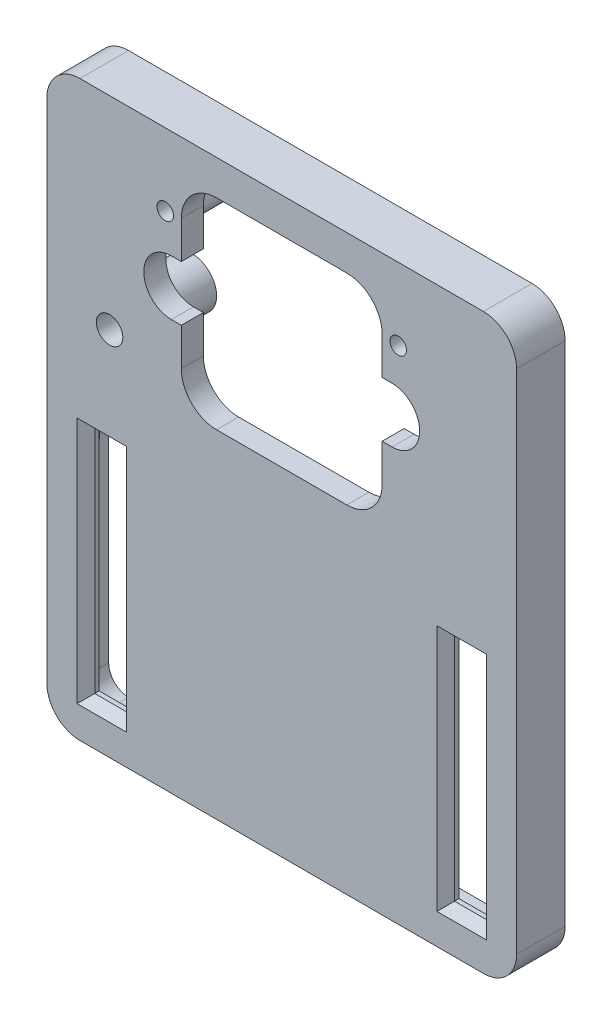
ISO-10303-21;
HEADER;
FILE_DESCRIPTION(('STEP AP214'),'2;1');
FILE_NAME('part.step','',(''),(''),'','','');
FILE_SCHEMA(('AUTOMOTIVE_DESIGN { 1 0 10303 214 1 1 1 1 }'));
ENDSEC;
DATA;
#1=APPLICATION_CONTEXT('core data for automotive mechanical design processes');
#2=APPLICATION_PROTOCOL_DEFINITION('international standard','automotive_design',2000,#1);
#3=PRODUCT_CONTEXT('',#1,'mechanical');
#4=PRODUCT('Part','Part','',(#3));
#5=PRODUCT_RELATED_PRODUCT_CATEGORY('part','',(#4));
#6=PRODUCT_DEFINITION_FORMATION('','',#4);
#7=PRODUCT_DEFINITION_CONTEXT('part definition',#1,'design');
#8=PRODUCT_DEFINITION('design','',#6,#7);
#9=PRODUCT_DEFINITION_SHAPE('','',#8);
#10=(LENGTH_UNIT() NAMED_UNIT(*) SI_UNIT(.MILLI.,.METRE.));
#11=(NAMED_UNIT(*) PLANE_ANGLE_UNIT() SI_UNIT($,.RADIAN.));
#12=(NAMED_UNIT(*) SI_UNIT($,.STERADIAN.) SOLID_ANGLE_UNIT());
#13=UNCERTAINTY_MEASURE_WITH_UNIT(LENGTH_MEASURE(1.E-05),#10,'distance_accuracy_value','');
#14=(GEOMETRIC_REPRESENTATION_CONTEXT(3) GLOBAL_UNCERTAINTY_ASSIGNED_CONTEXT((#13)) GLOBAL_UNIT_ASSIGNED_CONTEXT((#10,
#11,#12)) REPRESENTATION_CONTEXT('',''));
#15=CARTESIAN_POINT('',(0.,0.,0.));
#16=DIRECTION('',(0.,0.,1.));
#17=DIRECTION('',(1.,0.,0.));
#18=AXIS2_PLACEMENT_3D('',#15,#16,#17);
#19=CARTESIAN_POINT('',(20.08,22.975,-4.4));
#20=DIRECTION('',(-1.,0.,0.));
#21=DIRECTION('',(0.,0.,1.));
#22=AXIS2_PLACEMENT_3D('',#19,#20,#21);
#23=PLANE('',#22);
#24=DIRECTION('',(0.,-1.,0.));
#25=VECTOR('',#24,1.);
#26=CARTESIAN_POINT('',(20.08,22.975,-2.));
#27=LINE('',#26,#25);
#28=CARTESIAN_POINT('',(20.08,22.975,-2.));
#29=VERTEX_POINT('',#28);
#30=CARTESIAN_POINT('',(20.08,-22.975,-2.));
#31=VERTEX_POINT('',#30);
#32=EDGE_CURVE('E701',#29,#31,#27,.T.);
#33=ORIENTED_EDGE('',*,*,#32,.F.);
#34=DIRECTION('',(0.,0.,1.));
#35=VECTOR('',#34,1.);
#36=CARTESIAN_POINT('',(20.08,22.975,-4.4));
#37=LINE('',#36,#35);
#38=CARTESIAN_POINT('',(20.08,22.975,-4.4));
#39=VERTEX_POINT('',#38);
#40=EDGE_CURVE('E724',#39,#29,#37,.T.);
#41=ORIENTED_EDGE('',*,*,#40,.F.);
#42=DIRECTION('',(0.,-1.,0.));
#43=VECTOR('',#42,1.);
#44=CARTESIAN_POINT('',(20.08,22.975,-4.4));
#45=LINE('',#44,#43);
#46=CARTESIAN_POINT('',(20.08,-22.975,-4.4));
#47=VERTEX_POINT('',#46);
#48=EDGE_CURVE('E681',#39,#47,#45,.T.);
#49=ORIENTED_EDGE('',*,*,#48,.T.);
#50=DIRECTION('',(0.,0.,1.));
#51=VECTOR('',#50,1.);
#52=CARTESIAN_POINT('',(20.08,-22.975,-4.4));
#53=LINE('',#52,#51);
#54=EDGE_CURVE('E722',#47,#31,#53,.T.);
#55=ORIENTED_EDGE('',*,*,#54,.T.);
#56=EDGE_LOOP('',(#33,#41,#49,#55));
#57=FACE_BOUND('',#56,.T.);
#58=DIRECTION('',(0.,1.,0.));
#59=VECTOR('',#58,1.);
#60=CARTESIAN_POINT('',(20.08,-5.,-2.42857));
#61=LINE('',#60,#59);
#62=CARTESIAN_POINT('',(20.08,-5.,-2.42857));
#63=VERTEX_POINT('',#62);
#64=CARTESIAN_POINT('',(20.08,5.,-2.42857));
#65=VERTEX_POINT('',#64);
#66=EDGE_CURVE('E510',#63,#65,#61,.T.);
#67=ORIENTED_EDGE('',*,*,#66,.F.);
#68=DIRECTION('',(0.,0.,1.));
#69=VECTOR('',#68,1.);
#70=CARTESIAN_POINT('',(20.08,-5.,-2.42857));
#71=LINE('',#70,#69);
#72=CARTESIAN_POINT('',(20.08,-5.,-3.56857));
#73=VERTEX_POINT('',#72);
#74=EDGE_CURVE('E490',#73,#63,#71,.T.);
#75=ORIENTED_EDGE('',*,*,#74,.F.);
#76=DIRECTION('',(0.,1.,0.));
#77=VECTOR('',#76,1.);
#78=CARTESIAN_POINT('',(20.08,-5.,-3.56857));
#79=LINE('',#78,#77);
#80=CARTESIAN_POINT('',(20.08,5.,-3.56857));
#81=VERTEX_POINT('',#80);
#82=EDGE_CURVE('E489',#73,#81,#79,.T.);
#83=ORIENTED_EDGE('',*,*,#82,.T.);
#84=DIRECTION('',(0.,0.,1.));
#85=VECTOR('',#84,1.);
#86=CARTESIAN_POINT('',(20.08,5.,-2.42857));
#87=LINE('',#86,#85);
#88=EDGE_CURVE('E501',#81,#65,#87,.T.);
#89=ORIENTED_EDGE('',*,*,#88,.T.);
#90=EDGE_LOOP('',(#67,#75,#83,#89));
#91=FACE_BOUND('',#90,.T.);
#92=ADVANCED_FACE('F42',(#57,#91),#23,.T.);
#93=CARTESIAN_POINT('',(-20.08,-22.975,-4.4));
#94=DIRECTION('',(1.,0.,0.));
#95=DIRECTION('',(0.,1.,0.));
#96=AXIS2_PLACEMENT_3D('',#93,#94,#95);
#97=PLANE('',#96);
#98=DIRECTION('',(0.,1.,0.));
#99=VECTOR('',#98,1.);
#100=CARTESIAN_POINT('',(-20.08,-22.975,-2.));
#101=LINE('',#100,#99);
#102=CARTESIAN_POINT('',(-20.08,-22.975,-2.));
#103=VERTEX_POINT('',#102);
#104=CARTESIAN_POINT('',(-20.08,22.975,-2.));
#105=VERTEX_POINT('',#104);
#106=EDGE_CURVE('E677',#103,#105,#101,.T.);
#107=ORIENTED_EDGE('',*,*,#106,.F.);
#108=DIRECTION('',(0.,0.,1.));
#109=VECTOR('',#108,1.);
#110=CARTESIAN_POINT('',(-20.08,-22.975,-4.4));
#111=LINE('',#110,#109);
#112=CARTESIAN_POINT('',(-20.08,-22.975,-4.4));
#113=VERTEX_POINT('',#112);
#114=EDGE_CURVE('E716',#113,#103,#111,.T.);
#115=ORIENTED_EDGE('',*,*,#114,.F.);
#116=DIRECTION('',(0.,1.,0.));
#117=VECTOR('',#116,1.);
#118=CARTESIAN_POINT('',(-20.08,-22.975,-4.4));
#119=LINE('',#118,#117);
#120=CARTESIAN_POINT('',(-20.08,22.975,-4.4));
#121=VERTEX_POINT('',#120);
#122=EDGE_CURVE('E690',#113,#121,#119,.T.);
#123=ORIENTED_EDGE('',*,*,#122,.T.);
#124=DIRECTION('',(0.,0.,1.));
#125=VECTOR('',#124,1.);
#126=CARTESIAN_POINT('',(-20.08,22.975,-4.4));
#127=LINE('',#126,#125);
#128=EDGE_CURVE('E692',#121,#105,#127,.T.);
#129=ORIENTED_EDGE('',*,*,#128,.T.);
#130=EDGE_LOOP('',(#107,#115,#123,#129));
#131=FACE_BOUND('',#130,.T.);
#132=DIRECTION('',(0.,1.,0.));
#133=VECTOR('',#132,1.);
#134=CARTESIAN_POINT('',(-20.08,-5.,-3.56857));
#135=LINE('',#134,#133);
#136=CARTESIAN_POINT('',(-20.08,-5.,-3.56857));
#137=VERTEX_POINT('',#136);
#138=CARTESIAN_POINT('',(-20.08,5.,-3.56857));
#139=VERTEX_POINT('',#138);
#140=EDGE_CURVE('E520',#137,#139,#135,.T.);
#141=ORIENTED_EDGE('',*,*,#140,.F.);
#142=DIRECTION('',(0.,0.,-1.));
#143=VECTOR('',#142,1.);
#144=CARTESIAN_POINT('',(-20.08,-5.,-2.42857));
#145=LINE('',#144,#143);
#146=CARTESIAN_POINT('',(-20.08,-5.,-2.42857));
#147=VERTEX_POINT('',#146);
#148=EDGE_CURVE('E516',#147,#137,#145,.T.);
#149=ORIENTED_EDGE('',*,*,#148,.F.);
#150=DIRECTION('',(0.,1.,0.));
#151=VECTOR('',#150,1.);
#152=CARTESIAN_POINT('',(-20.08,-5.,-2.42857));
#153=LINE('',#152,#151);
#154=CARTESIAN_POINT('',(-20.08,5.,-2.42857));
#155=VERTEX_POINT('',#154);
#156=EDGE_CURVE('E517',#147,#155,#153,.T.);
#157=ORIENTED_EDGE('',*,*,#156,.T.);
#158=DIRECTION('',(0.,0.,-1.));
#159=VECTOR('',#158,1.);
#160=CARTESIAN_POINT('',(-20.08,5.,-2.42857));
#161=LINE('',#160,#159);
#162=EDGE_CURVE('E522',#155,#139,#161,.T.);
#163=ORIENTED_EDGE('',*,*,#162,.T.);
#164=EDGE_LOOP('',(#141,#149,#157,#163));
#165=FACE_BOUND('',#164,.T.);
#166=ADVANCED_FACE('F1093',(#131,#165),#97,.T.);
#167=CARTESIAN_POINT('',(18.28,-24.775,-4.4));
#168=DIRECTION('',(0.,1.,0.));
#169=DIRECTION('',(0.,0.,1.));
#170=AXIS2_PLACEMENT_3D('',#167,#168,#169);
#171=PLANE('',#170);
#172=DIRECTION('',(-1.,0.,0.));
#173=VECTOR('',#172,1.);
#174=CARTESIAN_POINT('',(18.28,-24.775,-2.));
#175=LINE('',#174,#173);
#176=CARTESIAN_POINT('',(18.28,-24.775,-2.));
#177=VERTEX_POINT('',#176);
#178=CARTESIAN_POINT('',(-18.28,-24.775,-2.));
#179=VERTEX_POINT('',#178);
#180=EDGE_CURVE('E707',#177,#179,#175,.T.);
#181=ORIENTED_EDGE('',*,*,#180,.F.);
#182=DIRECTION('',(0.,0.,1.));
#183=VECTOR('',#182,1.);
#184=CARTESIAN_POINT('',(18.28,-24.775,-4.4));
#185=LINE('',#184,#183);
#186=CARTESIAN_POINT('',(18.28,-24.775,-4.4));
#187=VERTEX_POINT('',#186);
#188=EDGE_CURVE('E720',#187,#177,#185,.T.);
#189=ORIENTED_EDGE('',*,*,#188,.F.);
#190=DIRECTION('',(-1.,0.,0.));
#191=VECTOR('',#190,1.);
#192=CARTESIAN_POINT('',(18.28,-24.775,-4.4));
#193=LINE('',#192,#191);
#194=CARTESIAN_POINT('',(-18.28,-24.775,-4.4));
#195=VERTEX_POINT('',#194);
#196=EDGE_CURVE('E685',#187,#195,#193,.T.);
#197=ORIENTED_EDGE('',*,*,#196,.T.);
#198=DIRECTION('',(0.,0.,1.));
#199=VECTOR('',#198,1.);
#200=CARTESIAN_POINT('',(-18.28,-24.775,-4.4));
#201=LINE('',#200,#199);
#202=EDGE_CURVE('E718',#195,#179,#201,.T.);
#203=ORIENTED_EDGE('',*,*,#202,.T.);
#204=EDGE_LOOP('',(#181,#189,#197,#203));
#205=FACE_BOUND('',#204,.T.);
#206=DIRECTION('',(1.,0.,0.));
#207=VECTOR('',#206,1.);
#208=CARTESIAN_POINT('',(-5.,-24.775,-2.42857));
#209=LINE('',#208,#207);
#210=CARTESIAN_POINT('',(-5.,-24.775,-2.42857));
#211=VERTEX_POINT('',#210);
#212=CARTESIAN_POINT('',(5.,-24.775,-2.42857));
#213=VERTEX_POINT('',#212);
#214=EDGE_CURVE('E512',#211,#213,#209,.T.);
#215=ORIENTED_EDGE('',*,*,#214,.F.);
#216=DIRECTION('',(0.,0.,1.));
#217=VECTOR('',#216,1.);
#218=CARTESIAN_POINT('',(-5.,-24.775,-2.42857));
#219=LINE('',#218,#217);
#220=CARTESIAN_POINT('',(-5.,-24.775,-3.57143));
#221=VERTEX_POINT('',#220);
#222=EDGE_CURVE('E565',#221,#211,#219,.T.);
#223=ORIENTED_EDGE('',*,*,#222,.F.);
#224=DIRECTION('',(1.,0.,0.));
#225=VECTOR('',#224,1.);
#226=CARTESIAN_POINT('',(-5.,-24.775,-3.57143));
#227=LINE('',#226,#225);
#228=CARTESIAN_POINT('',(5.,-24.775,-3.57143));
#229=VERTEX_POINT('',#228);
#230=EDGE_CURVE('E566',#221,#229,#227,.T.);
#231=ORIENTED_EDGE('',*,*,#230,.T.);
#232=DIRECTION('',(0.,0.,1.));
#233=VECTOR('',#232,1.);
#234=CARTESIAN_POINT('',(5.,-24.775,-2.42857));
#235=LINE('',#234,#233);
#236=EDGE_CURVE('E571',#229,#213,#235,.T.);
#237=ORIENTED_EDGE('',*,*,#236,.T.);
#238=EDGE_LOOP('',(#215,#223,#231,#237));
#239=FACE_BOUND('',#238,.T.);
#240=ADVANCED_FACE('F1099',(#205,#239),#171,.T.);
#241=CARTESIAN_POINT('',(-18.28,22.975,-2.));
#242=DIRECTION('',(0.,0.,1.));
#243=DIRECTION('',(1.,0.,0.));
#244=AXIS2_PLACEMENT_3D('',#241,#242,#243);
#245=PLANE('',#244);
#246=CARTESIAN_POINT('',(-15.59858,7.59860999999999,-2.));
#247=DIRECTION('',(0.,0.,1.));
#248=DIRECTION('',(1.,0.,0.));
#249=AXIS2_PLACEMENT_3D('',#246,#247,#248);
#250=CIRCLE('',#249,3.19999999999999);
#251=CARTESIAN_POINT('',(-12.39858,7.59860999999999,-2.));
#252=VERTEX_POINT('',#251);
#253=EDGE_CURVE('E11',#252,#252,#250,.T.);
#254=ORIENTED_EDGE('',*,*,#253,.T.);
#255=EDGE_LOOP('',(#254));
#256=FACE_BOUND('',#255,.T.);
#257=DIRECTION('',(1.,0.,0.));
#258=VECTOR('',#257,1.);
#259=CARTESIAN_POINT('',(10.,11.20192,-2.));
#260=LINE('',#259,#258);
#261=CARTESIAN_POINT('',(9.10000000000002,11.20192,-2.));
#262=VERTEX_POINT('',#261);
#263=CARTESIAN_POINT('',(10.,11.20192,-2.));
#264=VERTEX_POINT('',#263);
#265=EDGE_CURVE('E825',#262,#264,#260,.T.);
#266=ORIENTED_EDGE('',*,*,#265,.T.);
#267=CARTESIAN_POINT('',(10.,13.70192,-2.));
#268=DIRECTION('',(0.,0.,1.));
#269=DIRECTION('',(-1.,0.,0.));
#270=AXIS2_PLACEMENT_3D('',#267,#268,#269);
#271=CIRCLE('',#270,2.5);
#272=CARTESIAN_POINT('',(10.,16.20192,-2.));
#273=VERTEX_POINT('',#272);
#274=EDGE_CURVE('E779',#264,#273,#271,.T.);
#275=ORIENTED_EDGE('',*,*,#274,.T.);
#276=DIRECTION('',(-1.,0.,0.));
#277=VECTOR('',#276,1.);
#278=CARTESIAN_POINT('',(9.10000000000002,16.20192,-2.));
#279=LINE('',#278,#277);
#280=CARTESIAN_POINT('',(9.10000000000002,16.20192,-2.));
#281=VERTEX_POINT('',#280);
#282=EDGE_CURVE('E782',#273,#281,#279,.T.);
#283=ORIENTED_EDGE('',*,*,#282,.T.);
#284=DIRECTION('',(0.,1.,0.));
#285=VECTOR('',#284,1.);
#286=CARTESIAN_POINT('',(9.10000000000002,19.60192,-2.));
#287=LINE('',#286,#285);
#288=CARTESIAN_POINT('',(9.10000000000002,19.60192,-2.));
#289=VERTEX_POINT('',#288);
#290=EDGE_CURVE('E786',#281,#289,#287,.T.);
#291=ORIENTED_EDGE('',*,*,#290,.T.);
#292=CARTESIAN_POINT('',(5.90000000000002,19.60192,-2.));
#293=DIRECTION('',(0.,0.,1.));
#294=DIRECTION('',(-1.,0.,0.));
#295=AXIS2_PLACEMENT_3D('',#292,#293,#294);
#296=CIRCLE('',#295,3.2);
#297=CARTESIAN_POINT('',(5.90000000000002,22.80192,-2.));
#298=VERTEX_POINT('',#297);
#299=EDGE_CURVE('E789',#289,#298,#296,.T.);
#300=ORIENTED_EDGE('',*,*,#299,.T.);
#301=DIRECTION('',(-1.,0.,0.));
#302=VECTOR('',#301,1.);
#303=CARTESIAN_POINT('',(-5.89999999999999,22.80192,-2.));
#304=LINE('',#303,#302);
#305=CARTESIAN_POINT('',(-5.89999999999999,22.80192,-2.));
#306=VERTEX_POINT('',#305);
#307=EDGE_CURVE('E792',#298,#306,#304,.T.);
#308=ORIENTED_EDGE('',*,*,#307,.T.);
#309=CARTESIAN_POINT('',(-5.89999999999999,19.60192,-2.));
#310=DIRECTION('',(0.,0.,1.));
#311=DIRECTION('',(-1.,0.,0.));
#312=AXIS2_PLACEMENT_3D('',#309,#310,#311);
#313=CIRCLE('',#312,3.2);
#314=CARTESIAN_POINT('',(-9.09999999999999,19.60192,-2.));
#315=VERTEX_POINT('',#314);
#316=EDGE_CURVE('E795',#306,#315,#313,.T.);
#317=ORIENTED_EDGE('',*,*,#316,.T.);
#318=DIRECTION('',(0.,-1.,0.));
#319=VECTOR('',#318,1.);
#320=CARTESIAN_POINT('',(-9.09999999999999,19.60192,-2.));
#321=LINE('',#320,#319);
#322=CARTESIAN_POINT('',(-9.09999999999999,16.20192,-2.));
#323=VERTEX_POINT('',#322);
#324=EDGE_CURVE('E798',#315,#323,#321,.T.);
#325=ORIENTED_EDGE('',*,*,#324,.T.);
#326=DIRECTION('',(-1.,0.,0.));
#327=VECTOR('',#326,1.);
#328=CARTESIAN_POINT('',(-9.09999999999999,16.20192,-2.));
#329=LINE('',#328,#327);
#330=CARTESIAN_POINT('',(-9.99999999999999,16.20192,-2.));
#331=VERTEX_POINT('',#330);
#332=EDGE_CURVE('E801',#323,#331,#329,.T.);
#333=ORIENTED_EDGE('',*,*,#332,.T.);
#334=CARTESIAN_POINT('',(-9.99999999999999,13.70192,-2.));
#335=DIRECTION('',(0.,0.,1.));
#336=DIRECTION('',(1.,0.,0.));
#337=AXIS2_PLACEMENT_3D('',#334,#335,#336);
#338=CIRCLE('',#337,2.5);
#339=CARTESIAN_POINT('',(-9.99999999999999,11.20192,-2.));
#340=VERTEX_POINT('',#339);
#341=EDGE_CURVE('E804',#331,#340,#338,.T.);
#342=ORIENTED_EDGE('',*,*,#341,.T.);
#343=DIRECTION('',(1.,0.,0.));
#344=VECTOR('',#343,1.);
#345=CARTESIAN_POINT('',(-9.99999999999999,11.20192,-2.));
#346=LINE('',#345,#344);
#347=CARTESIAN_POINT('',(-9.09999999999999,11.20192,-2.));
#348=VERTEX_POINT('',#347);
#349=EDGE_CURVE('E807',#340,#348,#346,.T.);
#350=ORIENTED_EDGE('',*,*,#349,.T.);
#351=DIRECTION('',(0.,-1.,0.));
#352=VECTOR('',#351,1.);
#353=CARTESIAN_POINT('',(-9.09999999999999,11.20192,-2.));
#354=LINE('',#353,#352);
#355=CARTESIAN_POINT('',(-9.09999999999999,7.80191999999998,-2.));
#356=VERTEX_POINT('',#355);
#357=EDGE_CURVE('E810',#348,#356,#354,.T.);
#358=ORIENTED_EDGE('',*,*,#357,.T.);
#359=CARTESIAN_POINT('',(-5.89999999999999,7.80191999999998,-2.));
#360=DIRECTION('',(0.,0.,1.));
#361=DIRECTION('',(-1.,0.,0.));
#362=AXIS2_PLACEMENT_3D('',#359,#360,#361);
#363=CIRCLE('',#362,3.2);
#364=CARTESIAN_POINT('',(-5.89999999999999,4.60191999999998,-2.));
#365=VERTEX_POINT('',#364);
#366=EDGE_CURVE('E813',#356,#365,#363,.T.);
#367=ORIENTED_EDGE('',*,*,#366,.T.);
#368=DIRECTION('',(1.,0.,0.));
#369=VECTOR('',#368,1.);
#370=CARTESIAN_POINT('',(-5.89999999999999,4.60191999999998,-2.));
#371=LINE('',#370,#369);
#372=CARTESIAN_POINT('',(5.90000000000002,4.60191999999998,-2.));
#373=VERTEX_POINT('',#372);
#374=EDGE_CURVE('E816',#365,#373,#371,.T.);
#375=ORIENTED_EDGE('',*,*,#374,.T.);
#376=CARTESIAN_POINT('',(5.90000000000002,7.80191999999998,-2.));
#377=DIRECTION('',(0.,0.,1.));
#378=DIRECTION('',(-1.,0.,0.));
#379=AXIS2_PLACEMENT_3D('',#376,#377,#378);
#380=CIRCLE('',#379,3.2);
#381=CARTESIAN_POINT('',(9.10000000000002,7.80191999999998,-2.));
#382=VERTEX_POINT('',#381);
#383=EDGE_CURVE('E819',#373,#382,#380,.T.);
#384=ORIENTED_EDGE('',*,*,#383,.T.);
#385=DIRECTION('',(0.,1.,0.));
#386=VECTOR('',#385,1.);
#387=CARTESIAN_POINT('',(9.10000000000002,11.20192,-2.));
#388=LINE('',#387,#386);
#389=EDGE_CURVE('E822',#382,#262,#388,.T.);
#390=ORIENTED_EDGE('',*,*,#389,.T.);
#391=EDGE_LOOP('',(#266,#275,#283,#291,#300,#308,#317,#325,#333,#342,#350,#358,#367,#375,#384,#390));
#392=FACE_BOUND('',#391,.T.);
#393=DIRECTION('',(1.,0.,0.));
#394=VECTOR('',#393,1.);
#395=CARTESIAN_POINT('',(-18.28,-23.21,-2.));
#396=LINE('',#395,#394);
#397=CARTESIAN_POINT('',(-18.54,-23.21,-2.));
#398=VERTEX_POINT('',#397);
#399=CARTESIAN_POINT('',(-14.06,-23.21,-2.));
#400=VERTEX_POINT('',#399);
#401=EDGE_CURVE('E945',#398,#400,#396,.T.);
#402=ORIENTED_EDGE('',*,*,#401,.T.);
#403=DIRECTION('',(0.,1.,0.));
#404=VECTOR('',#403,1.);
#405=CARTESIAN_POINT('',(-14.06,22.975,-2.));
#406=LINE('',#405,#404);
#407=CARTESIAN_POINT('',(-14.06,-0.790000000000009,-2.));
#408=VERTEX_POINT('',#407);
#409=EDGE_CURVE('E964',#400,#408,#406,.T.);
#410=ORIENTED_EDGE('',*,*,#409,.T.);
#411=DIRECTION('',(-1.,0.,0.));
#412=VECTOR('',#411,1.);
#413=CARTESIAN_POINT('',(-18.28,-0.790000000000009,-2.));
#414=LINE('',#413,#412);
#415=CARTESIAN_POINT('',(-18.54,-0.790000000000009,-2.));
#416=VERTEX_POINT('',#415);
#417=EDGE_CURVE('E962',#408,#416,#414,.T.);
#418=ORIENTED_EDGE('',*,*,#417,.T.);
#419=DIRECTION('',(0.,-1.,0.));
#420=VECTOR('',#419,1.);
#421=CARTESIAN_POINT('',(-18.54,22.975,-2.));
#422=LINE('',#421,#420);
#423=EDGE_CURVE('E960',#416,#398,#422,.T.);
#424=ORIENTED_EDGE('',*,*,#423,.T.);
#425=EDGE_LOOP('',(#402,#410,#418,#424));
#426=FACE_BOUND('',#425,.T.);
#427=DIRECTION('',(0.,1.,0.));
#428=VECTOR('',#427,1.);
#429=CARTESIAN_POINT('',(18.54,22.975,-2.));
#430=LINE('',#429,#428);
#431=CARTESIAN_POINT('',(18.54,-23.21,-2.));
#432=VERTEX_POINT('',#431);
#433=CARTESIAN_POINT('',(18.54,-0.790000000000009,-2.));
#434=VERTEX_POINT('',#433);
#435=EDGE_CURVE('E969',#432,#434,#430,.T.);
#436=ORIENTED_EDGE('',*,*,#435,.T.);
#437=DIRECTION('',(-1.,0.,0.));
#438=VECTOR('',#437,1.);
#439=CARTESIAN_POINT('',(-18.28,-0.790000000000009,-2.));
#440=LINE('',#439,#438);
#441=CARTESIAN_POINT('',(14.06,-0.790000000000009,-2.));
#442=VERTEX_POINT('',#441);
#443=EDGE_CURVE('E973',#434,#442,#440,.T.);
#444=ORIENTED_EDGE('',*,*,#443,.T.);
#445=DIRECTION('',(0.,-1.,0.));
#446=VECTOR('',#445,1.);
#447=CARTESIAN_POINT('',(14.06,22.975,-2.));
#448=LINE('',#447,#446);
#449=CARTESIAN_POINT('',(14.06,-23.21,-2.));
#450=VERTEX_POINT('',#449);
#451=EDGE_CURVE('E971',#442,#450,#448,.T.);
#452=ORIENTED_EDGE('',*,*,#451,.T.);
#453=DIRECTION('',(1.,0.,0.));
#454=VECTOR('',#453,1.);
#455=CARTESIAN_POINT('',(-18.28,-23.21,-2.));
#456=LINE('',#455,#454);
#457=EDGE_CURVE('E967',#450,#432,#456,.T.);
#458=ORIENTED_EDGE('',*,*,#457,.T.);
#459=EDGE_LOOP('',(#436,#444,#452,#458));
#460=FACE_BOUND('',#459,.T.);
#461=ORIENTED_EDGE('',*,*,#106,.T.);
#462=CARTESIAN_POINT('',(-18.28,22.975,-2.));
#463=DIRECTION('',(0.,0.,-1.));
#464=DIRECTION('',(-1.,0.,0.));
#465=AXIS2_PLACEMENT_3D('',#462,#463,#464);
#466=CIRCLE('',#465,1.8);
#467=CARTESIAN_POINT('',(-18.28,24.775,-2.));
#468=VERTEX_POINT('',#467);
#469=EDGE_CURVE('E673',#105,#468,#466,.T.);
#470=ORIENTED_EDGE('',*,*,#469,.T.);
#471=DIRECTION('',(1.,0.,0.));
#472=VECTOR('',#471,1.);
#473=CARTESIAN_POINT('',(-18.28,24.775,-2.));
#474=LINE('',#473,#472);
#475=CARTESIAN_POINT('',(18.28,24.775,-2.));
#476=VERTEX_POINT('',#475);
#477=EDGE_CURVE('E695',#468,#476,#474,.T.);
#478=ORIENTED_EDGE('',*,*,#477,.T.);
#479=CARTESIAN_POINT('',(18.28,22.975,-2.));
#480=DIRECTION('',(0.,0.,-1.));
#481=DIRECTION('',(-1.,0.,0.));
#482=AXIS2_PLACEMENT_3D('',#479,#480,#481);
#483=CIRCLE('',#482,1.8);
#484=EDGE_CURVE('E698',#476,#29,#483,.T.);
#485=ORIENTED_EDGE('',*,*,#484,.T.);
#486=ORIENTED_EDGE('',*,*,#32,.T.);
#487=CARTESIAN_POINT('',(18.28,-22.975,-2.));
#488=DIRECTION('',(0.,0.,-1.));
#489=DIRECTION('',(-1.,0.,0.));
#490=AXIS2_PLACEMENT_3D('',#487,#488,#489);
#491=CIRCLE('',#490,1.8);
#492=EDGE_CURVE('E704',#31,#177,#491,.T.);
#493=ORIENTED_EDGE('',*,*,#492,.T.);
#494=ORIENTED_EDGE('',*,*,#180,.T.);
#495=CARTESIAN_POINT('',(-18.28,-22.975,-2.));
#496=DIRECTION('',(0.,0.,-1.));
#497=DIRECTION('',(-1.,0.,0.));
#498=AXIS2_PLACEMENT_3D('',#495,#496,#497);
#499=CIRCLE('',#498,1.8);
#500=EDGE_CURVE('E710',#179,#103,#499,.T.);
#501=ORIENTED_EDGE('',*,*,#500,.T.);
#502=EDGE_LOOP('',(#461,#470,#478,#485,#486,#493,#494,#501));
#503=FACE_BOUND('',#502,.T.);
#504=DIRECTION('',(0.,-1.,0.));
#505=VECTOR('',#504,1.);
#506=CARTESIAN_POINT('',(17.2747367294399,19.93509,-2.));
#507=LINE('',#506,#505);
#508=CARTESIAN_POINT('',(17.2747367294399,19.93509,-2.));
#509=VERTEX_POINT('',#508);
#510=CARTESIAN_POINT('',(17.2747367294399,18.93509,-2.));
#511=VERTEX_POINT('',#510);
#512=EDGE_CURVE('E649',#509,#511,#507,.T.);
#513=ORIENTED_EDGE('',*,*,#512,.F.);
#514=DIRECTION('',(1.,0.,0.));
#515=VECTOR('',#514,1.);
#516=CARTESIAN_POINT('',(11.8108867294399,19.93509,-2.));
#517=LINE('',#516,#515);
#518=CARTESIAN_POINT('',(11.8108867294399,19.93509,-2.));
#519=VERTEX_POINT('',#518);
#520=EDGE_CURVE('E639',#519,#509,#517,.T.);
#521=ORIENTED_EDGE('',*,*,#520,.F.);
#522=CARTESIAN_POINT('',(10.55699,19.43509,-2.));
#523=DIRECTION('',(0.,0.,1.));
#524=DIRECTION('',(1.,0.,0.));
#525=AXIS2_PLACEMENT_3D('',#522,#523,#524);
#526=CIRCLE('',#525,1.34991);
#527=CARTESIAN_POINT('',(11.8108867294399,18.93509,-2.));
#528=VERTEX_POINT('',#527);
#529=EDGE_CURVE('E1030',#528,#519,#526,.F.);
#530=ORIENTED_EDGE('',*,*,#529,.F.);
#531=DIRECTION('',(-1.,0.,0.));
#532=VECTOR('',#531,1.);
#533=CARTESIAN_POINT('',(11.8108867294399,18.93509,-2.));
#534=LINE('',#533,#532);
#535=EDGE_CURVE('E645',#511,#528,#534,.T.);
#536=ORIENTED_EDGE('',*,*,#535,.F.);
#537=EDGE_LOOP('',(#513,#521,#530,#536));
#538=FACE_BOUND('',#537,.T.);
#539=DIRECTION('',(0.,1.,0.));
#540=VECTOR('',#539,1.);
#541=CARTESIAN_POINT('',(-17.2747367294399,19.93509,-2.));
#542=LINE('',#541,#540);
#543=CARTESIAN_POINT('',(-17.2747367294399,18.93509,-2.));
#544=VERTEX_POINT('',#543);
#545=CARTESIAN_POINT('',(-17.2747367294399,19.93509,-2.));
#546=VERTEX_POINT('',#545);
#547=EDGE_CURVE('E619',#544,#546,#542,.T.);
#548=ORIENTED_EDGE('',*,*,#547,.F.);
#549=DIRECTION('',(-1.,0.,0.));
#550=VECTOR('',#549,1.);
#551=CARTESIAN_POINT('',(-11.8108867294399,18.93509,-2.));
#552=LINE('',#551,#550);
#553=CARTESIAN_POINT('',(-11.8108867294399,18.93509,-2.));
#554=VERTEX_POINT('',#553);
#555=EDGE_CURVE('E618',#554,#544,#552,.T.);
#556=ORIENTED_EDGE('',*,*,#555,.F.);
#557=CARTESIAN_POINT('',(-10.55699,19.43509,-2.));
#558=DIRECTION('',(0.,0.,1.));
#559=DIRECTION('',(1.,0.,0.));
#560=AXIS2_PLACEMENT_3D('',#557,#558,#559);
#561=CIRCLE('',#560,1.34991);
#562=CARTESIAN_POINT('',(-11.8108867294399,19.93509,-2.));
#563=VERTEX_POINT('',#562);
#564=EDGE_CURVE('E1071',#563,#554,#561,.F.);
#565=ORIENTED_EDGE('',*,*,#564,.F.);
#566=DIRECTION('',(1.,0.,0.));
#567=VECTOR('',#566,1.);
#568=CARTESIAN_POINT('',(-11.8108867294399,19.93509,-2.));
#569=LINE('',#568,#567);
#570=EDGE_CURVE('E623',#546,#563,#569,.T.);
#571=ORIENTED_EDGE('',*,*,#570,.F.);
#572=EDGE_LOOP('',(#548,#556,#565,#571));
#573=FACE_BOUND('',#572,.T.);
#574=ADVANCED_FACE('F1235',(#256,#392,#426,#460,#503,#538,#573),#245,.F.);
#575=CARTESIAN_POINT('',(-18.28,22.975,-2.));
#576=DIRECTION('',(0.,0.,1.));
#577=DIRECTION('',(1.,0.,0.));
#578=AXIS2_PLACEMENT_3D('',#575,#576,#577);
#579=CYLINDRICAL_SURFACE('',#578,3.);
#580=CARTESIAN_POINT('',(-18.28,22.975,0.));
#581=DIRECTION('',(0.,0.,1.));
#582=DIRECTION('',(1.,0.,0.));
#583=AXIS2_PLACEMENT_3D('',#580,#581,#582);
#584=CIRCLE('',#583,3.);
#585=CARTESIAN_POINT('',(-18.28,25.975,0.));
#586=VERTEX_POINT('',#585);
#587=CARTESIAN_POINT('',(-21.28,22.975,0.));
#588=VERTEX_POINT('',#587);
#589=EDGE_CURVE('E910',#586,#588,#584,.T.);
#590=ORIENTED_EDGE('',*,*,#589,.F.);
#591=DIRECTION('',(0.,0.,1.));
#592=VECTOR('',#591,1.);
#593=CARTESIAN_POINT('',(-18.28,25.975,-2.));
#594=LINE('',#593,#592);
#595=CARTESIAN_POINT('',(-18.28,25.975,-4.4));
#596=VERTEX_POINT('',#595);
#597=EDGE_CURVE('E943',#596,#586,#594,.T.);
#598=ORIENTED_EDGE('',*,*,#597,.F.);
#599=CARTESIAN_POINT('',(-18.28,22.975,-4.4));
#600=DIRECTION('',(0.,0.,-1.));
#601=DIRECTION('',(-1.,0.,0.));
#602=AXIS2_PLACEMENT_3D('',#599,#600,#601);
#603=CIRCLE('',#602,3.);
#604=CARTESIAN_POINT('',(-21.28,22.975,-4.4));
#605=VERTEX_POINT('',#604);
#606=EDGE_CURVE('E731',#605,#596,#603,.T.);
#607=ORIENTED_EDGE('',*,*,#606,.F.);
#608=DIRECTION('',(0.,0.,1.));
#609=VECTOR('',#608,1.);
#610=CARTESIAN_POINT('',(-21.28,22.975,-2.));
#611=LINE('',#610,#609);
#612=EDGE_CURVE('E942',#605,#588,#611,.T.);
#613=ORIENTED_EDGE('',*,*,#612,.T.);
#614=EDGE_LOOP('',(#590,#598,#607,#613));
#615=FACE_BOUND('',#614,.T.);
#616=ADVANCED_FACE('F1238',(#615),#579,.T.);
#617=CARTESIAN_POINT('',(18.28,25.975,-2.));
#618=DIRECTION('',(0.,1.,0.));
#619=DIRECTION('',(0.,0.,1.));
#620=AXIS2_PLACEMENT_3D('',#617,#618,#619);
#621=PLANE('',#620);
#622=DIRECTION('',(-1.,0.,0.));
#623=VECTOR('',#622,1.);
#624=CARTESIAN_POINT('',(18.28,25.975,0.));
#625=LINE('',#624,#623);
#626=CARTESIAN_POINT('',(18.28,25.975,0.));
#627=VERTEX_POINT('',#626);
#628=EDGE_CURVE('E939',#627,#586,#625,.T.);
#629=ORIENTED_EDGE('',*,*,#628,.F.);
#630=DIRECTION('',(0.,0.,1.));
#631=VECTOR('',#630,1.);
#632=CARTESIAN_POINT('',(18.28,25.975,-2.));
#633=LINE('',#632,#631);
#634=CARTESIAN_POINT('',(18.28,25.975,-4.4));
#635=VERTEX_POINT('',#634);
#636=EDGE_CURVE('E946',#635,#627,#633,.T.);
#637=ORIENTED_EDGE('',*,*,#636,.F.);
#638=DIRECTION('',(1.,0.,0.));
#639=VECTOR('',#638,1.);
#640=CARTESIAN_POINT('',(-18.28,25.975,-4.4));
#641=LINE('',#640,#639);
#642=EDGE_CURVE('E734',#596,#635,#641,.T.);
#643=ORIENTED_EDGE('',*,*,#642,.F.);
#644=ORIENTED_EDGE('',*,*,#597,.T.);
#645=EDGE_LOOP('',(#629,#637,#643,#644));
#646=FACE_BOUND('',#645,.T.);
#647=ADVANCED_FACE('F1244',(#646),#621,.T.);
#648=CARTESIAN_POINT('',(18.28,22.975,-2.));
#649=DIRECTION('',(0.,0.,1.));
#650=DIRECTION('',(1.,0.,0.));
#651=AXIS2_PLACEMENT_3D('',#648,#649,#650);
#652=CYLINDRICAL_SURFACE('',#651,3.);
#653=CARTESIAN_POINT('',(18.28,22.975,0.));
#654=DIRECTION('',(0.,0.,1.));
#655=DIRECTION('',(-1.,0.,0.));
#656=AXIS2_PLACEMENT_3D('',#653,#654,#655);
#657=CIRCLE('',#656,3.);
#658=CARTESIAN_POINT('',(21.28,22.975,0.));
#659=VERTEX_POINT('',#658);
#660=EDGE_CURVE('E936',#659,#627,#657,.T.);
#661=ORIENTED_EDGE('',*,*,#660,.F.);
#662=DIRECTION('',(0.,0.,1.));
#663=VECTOR('',#662,1.);
#664=CARTESIAN_POINT('',(21.28,22.975,-2.));
#665=LINE('',#664,#663);
#666=CARTESIAN_POINT('',(21.28,22.975,-4.4));
#667=VERTEX_POINT('',#666);
#668=EDGE_CURVE('E948',#667,#659,#665,.T.);
#669=ORIENTED_EDGE('',*,*,#668,.F.);
#670=CARTESIAN_POINT('',(18.28,22.975,-4.4));
#671=DIRECTION('',(0.,0.,-1.));
#672=DIRECTION('',(-1.,0.,0.));
#673=AXIS2_PLACEMENT_3D('',#670,#671,#672);
#674=CIRCLE('',#673,3.);
#675=EDGE_CURVE('E737',#635,#667,#674,.T.);
#676=ORIENTED_EDGE('',*,*,#675,.F.);
#677=ORIENTED_EDGE('',*,*,#636,.T.);
#678=EDGE_LOOP('',(#661,#669,#676,#677));
#679=FACE_BOUND('',#678,.T.);
#680=ADVANCED_FACE('F1247',(#679),#652,.T.);
#681=CARTESIAN_POINT('',(21.28,-22.975,-2.));
#682=DIRECTION('',(1.,0.,0.));
#683=DIRECTION('',(0.,0.,-1.));
#684=AXIS2_PLACEMENT_3D('',#681,#682,#683);
#685=PLANE('',#684);
#686=DIRECTION('',(0.,1.,0.));
#687=VECTOR('',#686,1.);
#688=CARTESIAN_POINT('',(21.28,-22.975,0.));
#689=LINE('',#688,#687);
#690=CARTESIAN_POINT('',(21.28,-22.975,0.));
#691=VERTEX_POINT('',#690);
#692=EDGE_CURVE('E933',#691,#659,#689,.T.);
#693=ORIENTED_EDGE('',*,*,#692,.F.);
#694=DIRECTION('',(0.,0.,1.));
#695=VECTOR('',#694,1.);
#696=CARTESIAN_POINT('',(21.28,-22.975,-2.));
#697=LINE('',#696,#695);
#698=CARTESIAN_POINT('',(21.28,-22.975,-4.4));
#699=VERTEX_POINT('',#698);
#700=EDGE_CURVE('E950',#699,#691,#697,.T.);
#701=ORIENTED_EDGE('',*,*,#700,.F.);
#702=DIRECTION('',(0.,-1.,0.));
#703=VECTOR('',#702,1.);
#704=CARTESIAN_POINT('',(21.28,22.975,-4.4));
#705=LINE('',#704,#703);
#706=EDGE_CURVE('E740',#667,#699,#705,.T.);
#707=ORIENTED_EDGE('',*,*,#706,.F.);
#708=ORIENTED_EDGE('',*,*,#668,.T.);
#709=EDGE_LOOP('',(#693,#701,#707,#708));
#710=FACE_BOUND('',#709,.T.);
#711=ADVANCED_FACE('F1251',(#710),#685,.T.);
#712=CARTESIAN_POINT('',(18.28,-22.975,-2.));
#713=DIRECTION('',(0.,0.,1.));
#714=DIRECTION('',(1.,0.,0.));
#715=AXIS2_PLACEMENT_3D('',#712,#713,#714);
#716=CYLINDRICAL_SURFACE('',#715,3.);
#717=CARTESIAN_POINT('',(18.28,-22.975,0.));
#718=DIRECTION('',(0.,0.,1.));
#719=DIRECTION('',(1.,0.,0.));
#720=AXIS2_PLACEMENT_3D('',#717,#718,#719);
#721=CIRCLE('',#720,3.);
#722=CARTESIAN_POINT('',(18.28,-25.975,0.));
#723=VERTEX_POINT('',#722);
#724=EDGE_CURVE('E930',#723,#691,#721,.T.);
#725=ORIENTED_EDGE('',*,*,#724,.F.);
#726=DIRECTION('',(0.,0.,1.));
#727=VECTOR('',#726,1.);
#728=CARTESIAN_POINT('',(18.28,-25.975,-2.));
#729=LINE('',#728,#727);
#730=CARTESIAN_POINT('',(18.28,-25.975,-4.4));
#731=VERTEX_POINT('',#730);
#732=EDGE_CURVE('E952',#731,#723,#729,.T.);
#733=ORIENTED_EDGE('',*,*,#732,.F.);
#734=CARTESIAN_POINT('',(18.28,-22.975,-4.4));
#735=DIRECTION('',(0.,0.,-1.));
#736=DIRECTION('',(-1.,0.,0.));
#737=AXIS2_PLACEMENT_3D('',#734,#735,#736);
#738=CIRCLE('',#737,3.);
#739=EDGE_CURVE('E743',#699,#731,#738,.T.);
#740=ORIENTED_EDGE('',*,*,#739,.F.);
#741=ORIENTED_EDGE('',*,*,#700,.T.);
#742=EDGE_LOOP('',(#725,#733,#740,#741));
#743=FACE_BOUND('',#742,.T.);
#744=ADVANCED_FACE('F1255',(#743),#716,.T.);
#745=CARTESIAN_POINT('',(-18.28,-25.975,-2.));
#746=DIRECTION('',(0.,-1.,0.));
#747=DIRECTION('',(0.,0.,-1.));
#748=AXIS2_PLACEMENT_3D('',#745,#746,#747);
#749=PLANE('',#748);
#750=DIRECTION('',(1.,0.,0.));
#751=VECTOR('',#750,1.);
#752=CARTESIAN_POINT('',(-18.28,-25.975,0.));
#753=LINE('',#752,#751);
#754=CARTESIAN_POINT('',(-18.28,-25.975,0.));
#755=VERTEX_POINT('',#754);
#756=EDGE_CURVE('E927',#755,#723,#753,.T.);
#757=ORIENTED_EDGE('',*,*,#756,.F.);
#758=DIRECTION('',(0.,0.,1.));
#759=VECTOR('',#758,1.);
#760=CARTESIAN_POINT('',(-18.28,-25.975,-2.));
#761=LINE('',#760,#759);
#762=CARTESIAN_POINT('',(-18.28,-25.975,-4.4));
#763=VERTEX_POINT('',#762);
#764=EDGE_CURVE('E954',#763,#755,#761,.T.);
#765=ORIENTED_EDGE('',*,*,#764,.F.);
#766=DIRECTION('',(-1.,0.,0.));
#767=VECTOR('',#766,1.);
#768=CARTESIAN_POINT('',(18.28,-25.975,-4.4));
#769=LINE('',#768,#767);
#770=EDGE_CURVE('E746',#731,#763,#769,.T.);
#771=ORIENTED_EDGE('',*,*,#770,.F.);
#772=ORIENTED_EDGE('',*,*,#732,.T.);
#773=EDGE_LOOP('',(#757,#765,#771,#772));
#774=FACE_BOUND('',#773,.T.);
#775=ADVANCED_FACE('F1259',(#774),#749,.T.);
#776=CARTESIAN_POINT('',(-18.28,-22.975,-2.));
#777=DIRECTION('',(0.,0.,1.));
#778=DIRECTION('',(1.,0.,0.));
#779=AXIS2_PLACEMENT_3D('',#776,#777,#778);
#780=CYLINDRICAL_SURFACE('',#779,3.);
#781=CARTESIAN_POINT('',(-18.28,-22.975,0.));
#782=DIRECTION('',(0.,0.,1.));
#783=DIRECTION('',(-1.,0.,0.));
#784=AXIS2_PLACEMENT_3D('',#781,#782,#783);
#785=CIRCLE('',#784,3.);
#786=CARTESIAN_POINT('',(-21.28,-22.975,0.));
#787=VERTEX_POINT('',#786);
#788=EDGE_CURVE('E924',#787,#755,#785,.T.);
#789=ORIENTED_EDGE('',*,*,#788,.F.);
#790=DIRECTION('',(0.,0.,1.));
#791=VECTOR('',#790,1.);
#792=CARTESIAN_POINT('',(-21.28,-22.975,-2.));
#793=LINE('',#792,#791);
#794=CARTESIAN_POINT('',(-21.28,-22.975,-4.4));
#795=VERTEX_POINT('',#794);
#796=EDGE_CURVE('E956',#795,#787,#793,.T.);
#797=ORIENTED_EDGE('',*,*,#796,.F.);
#798=CARTESIAN_POINT('',(-18.28,-22.975,-4.4));
#799=DIRECTION('',(0.,0.,-1.));
#800=DIRECTION('',(-1.,0.,0.));
#801=AXIS2_PLACEMENT_3D('',#798,#799,#800);
#802=CIRCLE('',#801,3.);
#803=EDGE_CURVE('E749',#763,#795,#802,.T.);
#804=ORIENTED_EDGE('',*,*,#803,.F.);
#805=ORIENTED_EDGE('',*,*,#764,.T.);
#806=EDGE_LOOP('',(#789,#797,#804,#805));
#807=FACE_BOUND('',#806,.T.);
#808=ADVANCED_FACE('F1263',(#807),#780,.T.);
#809=CARTESIAN_POINT('',(-21.28,22.975,-2.));
#810=DIRECTION('',(-1.,0.,0.));
#811=DIRECTION('',(0.,0.,1.));
#812=AXIS2_PLACEMENT_3D('',#809,#810,#811);
#813=PLANE('',#812);
#814=DIRECTION('',(0.,-1.,0.));
#815=VECTOR('',#814,1.);
#816=CARTESIAN_POINT('',(-21.28,22.975,0.));
#817=LINE('',#816,#815);
#818=EDGE_CURVE('E921',#588,#787,#817,.T.);
#819=ORIENTED_EDGE('',*,*,#818,.F.);
#820=ORIENTED_EDGE('',*,*,#612,.F.);
#821=DIRECTION('',(0.,1.,0.));
#822=VECTOR('',#821,1.);
#823=CARTESIAN_POINT('',(-21.28,-22.975,-4.4));
#824=LINE('',#823,#822);
#825=EDGE_CURVE('E752',#795,#605,#824,.T.);
#826=ORIENTED_EDGE('',*,*,#825,.F.);
#827=ORIENTED_EDGE('',*,*,#796,.T.);
#828=EDGE_LOOP('',(#819,#820,#826,#827));
#829=FACE_BOUND('',#828,.T.);
#830=ADVANCED_FACE('F1242',(#829),#813,.T.);
#831=CARTESIAN_POINT('',(-18.28,22.975,0.));
#832=DIRECTION('',(0.,0.,1.));
#833=DIRECTION('',(1.,0.,0.));
#834=AXIS2_PLACEMENT_3D('',#831,#832,#833);
#835=PLANE('',#834);
#836=DIRECTION('',(-1.,0.,0.));
#837=VECTOR('',#836,1.);
#838=CARTESIAN_POINT('',(14.86,-23.21,0.));
#839=LINE('',#838,#837);
#840=CARTESIAN_POINT('',(18.54,-23.21,0.));
#841=VERTEX_POINT('',#840);
#842=CARTESIAN_POINT('',(14.06,-23.21,0.));
#843=VERTEX_POINT('',#842);
#844=EDGE_CURVE('E1003',#841,#843,#839,.T.);
#845=ORIENTED_EDGE('',*,*,#844,.T.);
#846=DIRECTION('',(0.,1.,0.));
#847=VECTOR('',#846,1.);
#848=CARTESIAN_POINT('',(14.06,-1.59,0.));
#849=LINE('',#848,#847);
#850=CARTESIAN_POINT('',(14.06,-0.790000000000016,0.));
#851=VERTEX_POINT('',#850);
#852=EDGE_CURVE('E1009',#843,#851,#849,.T.);
#853=ORIENTED_EDGE('',*,*,#852,.T.);
#854=DIRECTION('',(1.,0.,0.));
#855=VECTOR('',#854,1.);
#856=CARTESIAN_POINT('',(17.74,-0.790000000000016,0.));
#857=LINE('',#856,#855);
#858=CARTESIAN_POINT('',(18.54,-0.790000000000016,0.));
#859=VERTEX_POINT('',#858);
#860=EDGE_CURVE('E1007',#851,#859,#857,.T.);
#861=ORIENTED_EDGE('',*,*,#860,.T.);
#862=DIRECTION('',(0.,-1.,0.));
#863=VECTOR('',#862,1.);
#864=CARTESIAN_POINT('',(18.54,-22.41,0.));
#865=LINE('',#864,#863);
#866=EDGE_CURVE('E1005',#859,#841,#865,.T.);
#867=ORIENTED_EDGE('',*,*,#866,.T.);
#868=EDGE_LOOP('',(#845,#853,#861,#867));
#869=FACE_BOUND('',#868,.T.);
#870=DIRECTION('',(-1.,0.,0.));
#871=VECTOR('',#870,1.);
#872=CARTESIAN_POINT('',(-17.74,-23.21,0.));
#873=LINE('',#872,#871);
#874=CARTESIAN_POINT('',(-14.06,-23.21,0.));
#875=VERTEX_POINT('',#874);
#876=CARTESIAN_POINT('',(-18.54,-23.21,0.));
#877=VERTEX_POINT('',#876);
#878=EDGE_CURVE('E998',#875,#877,#873,.T.);
#879=ORIENTED_EDGE('',*,*,#878,.T.);
#880=DIRECTION('',(0.,1.,0.));
#881=VECTOR('',#880,1.);
#882=CARTESIAN_POINT('',(-18.54,-1.59,0.));
#883=LINE('',#882,#881);
#884=CARTESIAN_POINT('',(-18.54,-0.790000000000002,0.));
#885=VERTEX_POINT('',#884);
#886=EDGE_CURVE('E1000',#877,#885,#883,.T.);
#887=ORIENTED_EDGE('',*,*,#886,.T.);
#888=DIRECTION('',(1.,0.,0.));
#889=VECTOR('',#888,1.);
#890=CARTESIAN_POINT('',(-14.86,-0.790000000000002,0.));
#891=LINE('',#890,#889);
#892=CARTESIAN_POINT('',(-14.06,-0.790000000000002,0.));
#893=VERTEX_POINT('',#892);
#894=EDGE_CURVE('E996',#885,#893,#891,.T.);
#895=ORIENTED_EDGE('',*,*,#894,.T.);
#896=DIRECTION('',(0.,-1.,0.));
#897=VECTOR('',#896,1.);
#898=CARTESIAN_POINT('',(-14.06,-22.41,0.));
#899=LINE('',#898,#897);
#900=EDGE_CURVE('E994',#893,#875,#899,.T.);
#901=ORIENTED_EDGE('',*,*,#900,.T.);
#902=EDGE_LOOP('',(#879,#887,#895,#901));
#903=FACE_BOUND('',#902,.T.);
#904=CARTESIAN_POINT('',(-10.55699,19.43509,0.));
#905=DIRECTION('',(0.,0.,1.));
#906=DIRECTION('',(-1.,0.,0.));
#907=AXIS2_PLACEMENT_3D('',#904,#905,#906);
#908=CIRCLE('',#907,0.75);
#909=CARTESIAN_POINT('',(-11.30699,19.43509,0.));
#910=VERTEX_POINT('',#909);
#911=EDGE_CURVE('E756',#910,#910,#908,.T.);
#912=ORIENTED_EDGE('',*,*,#911,.F.);
#913=EDGE_LOOP('',(#912));
#914=FACE_BOUND('',#913,.T.);
#915=CARTESIAN_POINT('',(10.55699,19.43509,0.));
#916=DIRECTION('',(0.,0.,1.));
#917=DIRECTION('',(1.,0.,0.));
#918=AXIS2_PLACEMENT_3D('',#915,#916,#917);
#919=CIRCLE('',#918,0.75);
#920=CARTESIAN_POINT('',(11.30699,19.43509,0.));
#921=VERTEX_POINT('',#920);
#922=EDGE_CURVE('E759',#921,#921,#919,.T.);
#923=ORIENTED_EDGE('',*,*,#922,.F.);
#924=EDGE_LOOP('',(#923));
#925=FACE_BOUND('',#924,.T.);
#926=CARTESIAN_POINT('',(-15.59858,7.59860999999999,0.));
#927=DIRECTION('',(0.,0.,1.));
#928=DIRECTION('',(1.,0.,0.));
#929=AXIS2_PLACEMENT_3D('',#926,#927,#928);
#930=CIRCLE('',#929,1.2);
#931=CARTESIAN_POINT('',(-14.39858,7.59860999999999,0.));
#932=VERTEX_POINT('',#931);
#933=EDGE_CURVE('E763',#932,#932,#930,.T.);
#934=ORIENTED_EDGE('',*,*,#933,.F.);
#935=EDGE_LOOP('',(#934));
#936=FACE_BOUND('',#935,.T.);
#937=CARTESIAN_POINT('',(10.,13.70192,0.));
#938=DIRECTION('',(0.,0.,1.));
#939=DIRECTION('',(-1.,0.,0.));
#940=AXIS2_PLACEMENT_3D('',#937,#938,#939);
#941=CIRCLE('',#940,2.5);
#942=CARTESIAN_POINT('',(10.,11.20192,0.));
#943=VERTEX_POINT('',#942);
#944=CARTESIAN_POINT('',(10.,16.20192,0.));
#945=VERTEX_POINT('',#944);
#946=EDGE_CURVE('E770',#943,#945,#941,.T.);
#947=ORIENTED_EDGE('',*,*,#946,.F.);
#948=DIRECTION('',(1.,0.,0.));
#949=VECTOR('',#948,1.);
#950=CARTESIAN_POINT('',(10.,11.20192,0.));
#951=LINE('',#950,#949);
#952=CARTESIAN_POINT('',(9.10000000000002,11.20192,0.));
#953=VERTEX_POINT('',#952);
#954=EDGE_CURVE('E783',#953,#943,#951,.T.);
#955=ORIENTED_EDGE('',*,*,#954,.F.);
#956=DIRECTION('',(0.,1.,0.));
#957=VECTOR('',#956,1.);
#958=CARTESIAN_POINT('',(9.10000000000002,11.20192,0.));
#959=LINE('',#958,#957);
#960=CARTESIAN_POINT('',(9.10000000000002,7.80191999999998,0.));
#961=VERTEX_POINT('',#960);
#962=EDGE_CURVE('E869',#961,#953,#959,.T.);
#963=ORIENTED_EDGE('',*,*,#962,.F.);
#964=CARTESIAN_POINT('',(5.90000000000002,7.80191999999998,0.));
#965=DIRECTION('',(0.,0.,1.));
#966=DIRECTION('',(-1.,0.,0.));
#967=AXIS2_PLACEMENT_3D('',#964,#965,#966);
#968=CIRCLE('',#967,3.2);
#969=CARTESIAN_POINT('',(5.90000000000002,4.60191999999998,0.));
#970=VERTEX_POINT('',#969);
#971=EDGE_CURVE('E866',#970,#961,#968,.T.);
#972=ORIENTED_EDGE('',*,*,#971,.F.);
#973=DIRECTION('',(1.,0.,0.));
#974=VECTOR('',#973,1.);
#975=CARTESIAN_POINT('',(-5.89999999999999,4.60191999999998,0.));
#976=LINE('',#975,#974);
#977=CARTESIAN_POINT('',(-5.89999999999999,4.60191999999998,0.));
#978=VERTEX_POINT('',#977);
#979=EDGE_CURVE('E863',#978,#970,#976,.T.);
#980=ORIENTED_EDGE('',*,*,#979,.F.);
#981=CARTESIAN_POINT('',(-5.89999999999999,7.80191999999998,0.));
#982=DIRECTION('',(0.,0.,1.));
#983=DIRECTION('',(-1.,0.,0.));
#984=AXIS2_PLACEMENT_3D('',#981,#982,#983);
#985=CIRCLE('',#984,3.2);
#986=CARTESIAN_POINT('',(-9.09999999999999,7.80191999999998,0.));
#987=VERTEX_POINT('',#986);
#988=EDGE_CURVE('E860',#987,#978,#985,.T.);
#989=ORIENTED_EDGE('',*,*,#988,.F.);
#990=DIRECTION('',(0.,-1.,0.));
#991=VECTOR('',#990,1.);
#992=CARTESIAN_POINT('',(-9.09999999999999,11.20192,0.));
#993=LINE('',#992,#991);
#994=CARTESIAN_POINT('',(-9.09999999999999,11.20192,0.));
#995=VERTEX_POINT('',#994);
#996=EDGE_CURVE('E857',#995,#987,#993,.T.);
#997=ORIENTED_EDGE('',*,*,#996,.F.);
#998=DIRECTION('',(1.,0.,0.));
#999=VECTOR('',#998,1.);
#1000=CARTESIAN_POINT('',(-9.99999999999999,11.20192,0.));
#1001=LINE('',#1000,#999);
#1002=CARTESIAN_POINT('',(-9.99999999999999,11.20192,0.));
#1003=VERTEX_POINT('',#1002);
#1004=EDGE_CURVE('E854',#1003,#995,#1001,.T.);
#1005=ORIENTED_EDGE('',*,*,#1004,.F.);
#1006=CARTESIAN_POINT('',(-9.99999999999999,13.70192,0.));
#1007=DIRECTION('',(0.,0.,1.));
#1008=DIRECTION('',(1.,0.,0.));
#1009=AXIS2_PLACEMENT_3D('',#1006,#1007,#1008);
#1010=CIRCLE('',#1009,2.5);
#1011=CARTESIAN_POINT('',(-9.99999999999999,16.20192,0.));
#1012=VERTEX_POINT('',#1011);
#1013=EDGE_CURVE('E851',#1012,#1003,#1010,.T.);
#1014=ORIENTED_EDGE('',*,*,#1013,.F.);
#1015=DIRECTION('',(-1.,0.,0.));
#1016=VECTOR('',#1015,1.);
#1017=CARTESIAN_POINT('',(-9.09999999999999,16.20192,0.));
#1018=LINE('',#1017,#1016);
#1019=CARTESIAN_POINT('',(-9.09999999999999,16.20192,0.));
#1020=VERTEX_POINT('',#1019);
#1021=EDGE_CURVE('E848',#1020,#1012,#1018,.T.);
#1022=ORIENTED_EDGE('',*,*,#1021,.F.);
#1023=DIRECTION('',(0.,-1.,0.));
#1024=VECTOR('',#1023,1.);
#1025=CARTESIAN_POINT('',(-9.09999999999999,19.60192,0.));
#1026=LINE('',#1025,#1024);
#1027=CARTESIAN_POINT('',(-9.09999999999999,19.60192,0.));
#1028=VERTEX_POINT('',#1027);
#1029=EDGE_CURVE('E845',#1028,#1020,#1026,.T.);
#1030=ORIENTED_EDGE('',*,*,#1029,.F.);
#1031=CARTESIAN_POINT('',(-5.89999999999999,19.60192,0.));
#1032=DIRECTION('',(0.,0.,1.));
#1033=DIRECTION('',(-1.,0.,0.));
#1034=AXIS2_PLACEMENT_3D('',#1031,#1032,#1033);
#1035=CIRCLE('',#1034,3.2);
#1036=CARTESIAN_POINT('',(-5.89999999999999,22.80192,0.));
#1037=VERTEX_POINT('',#1036);
#1038=EDGE_CURVE('E842',#1037,#1028,#1035,.T.);
#1039=ORIENTED_EDGE('',*,*,#1038,.F.);
#1040=DIRECTION('',(-1.,0.,0.));
#1041=VECTOR('',#1040,1.);
#1042=CARTESIAN_POINT('',(-5.89999999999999,22.80192,0.));
#1043=LINE('',#1042,#1041);
#1044=CARTESIAN_POINT('',(5.90000000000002,22.80192,0.));
#1045=VERTEX_POINT('',#1044);
#1046=EDGE_CURVE('E839',#1045,#1037,#1043,.T.);
#1047=ORIENTED_EDGE('',*,*,#1046,.F.);
#1048=CARTESIAN_POINT('',(5.90000000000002,19.60192,0.));
#1049=DIRECTION('',(0.,0.,1.));
#1050=DIRECTION('',(-1.,0.,0.));
#1051=AXIS2_PLACEMENT_3D('',#1048,#1049,#1050);
#1052=CIRCLE('',#1051,3.2);
#1053=CARTESIAN_POINT('',(9.10000000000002,19.60192,0.));
#1054=VERTEX_POINT('',#1053);
#1055=EDGE_CURVE('E836',#1054,#1045,#1052,.T.);
#1056=ORIENTED_EDGE('',*,*,#1055,.F.);
#1057=DIRECTION('',(0.,1.,0.));
#1058=VECTOR('',#1057,1.);
#1059=CARTESIAN_POINT('',(9.10000000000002,19.60192,0.));
#1060=LINE('',#1059,#1058);
#1061=CARTESIAN_POINT('',(9.10000000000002,16.20192,0.));
#1062=VERTEX_POINT('',#1061);
#1063=EDGE_CURVE('E833',#1062,#1054,#1060,.T.);
#1064=ORIENTED_EDGE('',*,*,#1063,.F.);
#1065=DIRECTION('',(-1.,0.,0.));
#1066=VECTOR('',#1065,1.);
#1067=CARTESIAN_POINT('',(9.10000000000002,16.20192,0.));
#1068=LINE('',#1067,#1066);
#1069=EDGE_CURVE('E830',#945,#1062,#1068,.T.);
#1070=ORIENTED_EDGE('',*,*,#1069,.F.);
#1071=EDGE_LOOP('',(#947,#955,#963,#972,#980,#989,#997,#1005,#1014,#1022,#1030,#1039,#1047,
#1056,#1064,#1070));
#1072=FACE_BOUND('',#1071,.T.);
#1073=ORIENTED_EDGE('',*,*,#589,.T.);
#1074=ORIENTED_EDGE('',*,*,#818,.T.);
#1075=ORIENTED_EDGE('',*,*,#788,.T.);
#1076=ORIENTED_EDGE('',*,*,#756,.T.);
#1077=ORIENTED_EDGE('',*,*,#724,.T.);
#1078=ORIENTED_EDGE('',*,*,#692,.T.);
#1079=ORIENTED_EDGE('',*,*,#660,.T.);
#1080=ORIENTED_EDGE('',*,*,#628,.T.);
#1081=EDGE_LOOP('',(#1073,#1074,#1075,#1076,#1077,#1078,#1079,#1080));
#1082=FACE_BOUND('',#1081,.T.);
#1083=ADVANCED_FACE('F1233',(#869,#903,#914,#925,#936,#1072,#1082),#835,.T.);
#1084=CARTESIAN_POINT('',(-17.74,-1.59,-2.));
#1085=DIRECTION('',(-1.,0.,0.));
#1086=DIRECTION('',(0.,-1.,0.));
#1087=AXIS2_PLACEMENT_3D('',#1084,#1085,#1086);
#1088=PLANE('',#1087);
#1089=DIRECTION('',(0.,0.,1.));
#1090=VECTOR('',#1089,1.);
#1091=CARTESIAN_POINT('',(-17.74,-22.41,-2.));
#1092=LINE('',#1091,#1090);
#1093=CARTESIAN_POINT('',(-17.74,-22.41,-1.2));
#1094=VERTEX_POINT('',#1093);
#1095=CARTESIAN_POINT('',(-17.74,-22.41,-0.800000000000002));
#1096=VERTEX_POINT('',#1095);
#1097=EDGE_CURVE('E876',#1094,#1096,#1092,.T.);
#1098=ORIENTED_EDGE('',*,*,#1097,.F.);
#1099=DIRECTION('',(0.,1.,0.));
#1100=VECTOR('',#1099,1.);
#1101=CARTESIAN_POINT('',(-17.74,-1.59,-1.2));
#1102=LINE('',#1101,#1100);
#1103=CARTESIAN_POINT('',(-17.74,-1.59,-1.2));
#1104=VERTEX_POINT('',#1103);
#1105=EDGE_CURVE('E1024',#1094,#1104,#1102,.T.);
#1106=ORIENTED_EDGE('',*,*,#1105,.T.);
#1107=DIRECTION('',(0.,0.,1.));
#1108=VECTOR('',#1107,1.);
#1109=CARTESIAN_POINT('',(-17.74,-1.59,-2.));
#1110=LINE('',#1109,#1108);
#1111=CARTESIAN_POINT('',(-17.74,-1.59,-0.800000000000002));
#1112=VERTEX_POINT('',#1111);
#1113=EDGE_CURVE('E907',#1104,#1112,#1110,.T.);
#1114=ORIENTED_EDGE('',*,*,#1113,.T.);
#1115=DIRECTION('',(0.,-1.,0.));
#1116=VECTOR('',#1115,1.);
#1117=CARTESIAN_POINT('',(-17.74,-22.41,-0.800000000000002));
#1118=LINE('',#1117,#1116);
#1119=EDGE_CURVE('E1021',#1112,#1096,#1118,.T.);
#1120=ORIENTED_EDGE('',*,*,#1119,.T.);
#1121=EDGE_LOOP('',(#1098,#1106,#1114,#1120));
#1122=FACE_BOUND('',#1121,.T.);
#1123=ADVANCED_FACE('F1223',(#1122),#1088,.F.);
#1124=CARTESIAN_POINT('',(-17.74,-1.59,-2.));
#1125=DIRECTION('',(0.,1.,0.));
#1126=DIRECTION('',(0.,0.,1.));
#1127=AXIS2_PLACEMENT_3D('',#1124,#1125,#1126);
#1128=PLANE('',#1127);
#1129=ORIENTED_EDGE('',*,*,#1113,.F.);
#1130=DIRECTION('',(1.,0.,0.));
#1131=VECTOR('',#1130,1.);
#1132=CARTESIAN_POINT('',(-17.74,-1.59,-1.2));
#1133=LINE('',#1132,#1131);
#1134=CARTESIAN_POINT('',(-14.86,-1.59,-1.2));
#1135=VERTEX_POINT('',#1134);
#1136=EDGE_CURVE('E1019',#1104,#1135,#1133,.T.);
#1137=ORIENTED_EDGE('',*,*,#1136,.T.);
#1138=DIRECTION('',(0.,0.,1.));
#1139=VECTOR('',#1138,1.);
#1140=CARTESIAN_POINT('',(-14.86,-1.59,-2.));
#1141=LINE('',#1140,#1139);
#1142=CARTESIAN_POINT('',(-14.86,-1.59,-0.800000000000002));
#1143=VERTEX_POINT('',#1142);
#1144=EDGE_CURVE('E911',#1135,#1143,#1141,.T.);
#1145=ORIENTED_EDGE('',*,*,#1144,.T.);
#1146=DIRECTION('',(-1.,0.,0.));
#1147=VECTOR('',#1146,1.);
#1148=CARTESIAN_POINT('',(-17.74,-1.59,-0.800000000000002));
#1149=LINE('',#1148,#1147);
#1150=EDGE_CURVE('E1017',#1143,#1112,#1149,.T.);
#1151=ORIENTED_EDGE('',*,*,#1150,.T.);
#1152=EDGE_LOOP('',(#1129,#1137,#1145,#1151));
#1153=FACE_BOUND('',#1152,.T.);
#1154=ADVANCED_FACE('F1219',(#1153),#1128,.F.);
#1155=CARTESIAN_POINT('',(-14.86,-1.59,-2.));
#1156=DIRECTION('',(1.,0.,0.));
#1157=DIRECTION('',(0.,1.,0.));
#1158=AXIS2_PLACEMENT_3D('',#1155,#1156,#1157);
#1159=PLANE('',#1158);
#1160=ORIENTED_EDGE('',*,*,#1144,.F.);
#1161=DIRECTION('',(0.,-1.,0.));
#1162=VECTOR('',#1161,1.);
#1163=CARTESIAN_POINT('',(-14.86,-1.59,-1.2));
#1164=LINE('',#1163,#1162);
#1165=CARTESIAN_POINT('',(-14.86,-22.41,-1.2));
#1166=VERTEX_POINT('',#1165);
#1167=EDGE_CURVE('E1014',#1135,#1166,#1164,.T.);
#1168=ORIENTED_EDGE('',*,*,#1167,.T.);
#1169=DIRECTION('',(0.,0.,1.));
#1170=VECTOR('',#1169,1.);
#1171=CARTESIAN_POINT('',(-14.86,-22.41,-2.));
#1172=LINE('',#1171,#1170);
#1173=CARTESIAN_POINT('',(-14.86,-22.41,-0.800000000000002));
#1174=VERTEX_POINT('',#1173);
#1175=EDGE_CURVE('E914',#1166,#1174,#1172,.T.);
#1176=ORIENTED_EDGE('',*,*,#1175,.T.);
#1177=DIRECTION('',(0.,1.,0.));
#1178=VECTOR('',#1177,1.);
#1179=CARTESIAN_POINT('',(-14.86,-1.59,-0.800000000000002));
#1180=LINE('',#1179,#1178);
#1181=EDGE_CURVE('E1012',#1174,#1143,#1180,.T.);
#1182=ORIENTED_EDGE('',*,*,#1181,.T.);
#1183=EDGE_LOOP('',(#1160,#1168,#1176,#1182));
#1184=FACE_BOUND('',#1183,.T.);
#1185=ADVANCED_FACE('F1222',(#1184),#1159,.F.);
#1186=CARTESIAN_POINT('',(-17.74,-22.41,-2.));
#1187=DIRECTION('',(0.,-1.,0.));
#1188=DIRECTION('',(0.,0.,-1.));
#1189=AXIS2_PLACEMENT_3D('',#1186,#1187,#1188);
#1190=PLANE('',#1189);
#1191=ORIENTED_EDGE('',*,*,#1175,.F.);
#1192=DIRECTION('',(-1.,0.,0.));
#1193=VECTOR('',#1192,1.);
#1194=CARTESIAN_POINT('',(-17.74,-22.41,-1.2));
#1195=LINE('',#1194,#1193);
#1196=EDGE_CURVE('E1028',#1166,#1094,#1195,.T.);
#1197=ORIENTED_EDGE('',*,*,#1196,.T.);
#1198=ORIENTED_EDGE('',*,*,#1097,.T.);
#1199=DIRECTION('',(1.,0.,0.));
#1200=VECTOR('',#1199,1.);
#1201=CARTESIAN_POINT('',(-14.86,-22.41,-0.800000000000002));
#1202=LINE('',#1201,#1200);
#1203=EDGE_CURVE('E1026',#1096,#1174,#1202,.T.);
#1204=ORIENTED_EDGE('',*,*,#1203,.T.);
#1205=EDGE_LOOP('',(#1191,#1197,#1198,#1204));
#1206=FACE_BOUND('',#1205,.T.);
#1207=ADVANCED_FACE('F1217',(#1206),#1190,.F.);
#1208=CARTESIAN_POINT('',(10.,13.70192,-2.));
#1209=DIRECTION('',(0.,0.,1.));
#1210=DIRECTION('',(1.,0.,0.));
#1211=AXIS2_PLACEMENT_3D('',#1208,#1209,#1210);
#1212=CYLINDRICAL_SURFACE('',#1211,2.5);
#1213=ORIENTED_EDGE('',*,*,#946,.T.);
#1214=DIRECTION('',(0.,0.,1.));
#1215=VECTOR('',#1214,1.);
#1216=CARTESIAN_POINT('',(10.,16.20192,-2.));
#1217=LINE('',#1216,#1215);
#1218=EDGE_CURVE('E828',#273,#945,#1217,.T.);
#1219=ORIENTED_EDGE('',*,*,#1218,.F.);
#1220=ORIENTED_EDGE('',*,*,#274,.F.);
#1221=DIRECTION('',(0.,0.,1.));
#1222=VECTOR('',#1221,1.);
#1223=CARTESIAN_POINT('',(10.,11.20192,-2.));
#1224=LINE('',#1223,#1222);
#1225=EDGE_CURVE('E874',#264,#943,#1224,.T.);
#1226=ORIENTED_EDGE('',*,*,#1225,.T.);
#1227=EDGE_LOOP('',(#1213,#1219,#1220,#1226));
#1228=FACE_BOUND('',#1227,.T.);
#1229=ADVANCED_FACE('F1159',(#1228),#1212,.F.);
#1230=CARTESIAN_POINT('',(10.,11.20192,-2.));
#1231=DIRECTION('',(0.,-1.,0.));
#1232=DIRECTION('',(1.,0.,0.));
#1233=AXIS2_PLACEMENT_3D('',#1230,#1231,#1232);
#1234=PLANE('',#1233);
#1235=ORIENTED_EDGE('',*,*,#954,.T.);
#1236=ORIENTED_EDGE('',*,*,#1225,.F.);
#1237=ORIENTED_EDGE('',*,*,#265,.F.);
#1238=DIRECTION('',(0.,0.,1.));
#1239=VECTOR('',#1238,1.);
#1240=CARTESIAN_POINT('',(9.10000000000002,11.20192,-2.));
#1241=LINE('',#1240,#1239);
#1242=EDGE_CURVE('E877',#262,#953,#1241,.T.);
#1243=ORIENTED_EDGE('',*,*,#1242,.T.);
#1244=EDGE_LOOP('',(#1235,#1236,#1237,#1243));
#1245=FACE_BOUND('',#1244,.T.);
#1246=ADVANCED_FACE('F1155',(#1245),#1234,.F.);
#1247=CARTESIAN_POINT('',(9.10000000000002,11.20192,-2.));
#1248=DIRECTION('',(1.,0.,0.));
#1249=DIRECTION('',(0.,1.,0.));
#1250=AXIS2_PLACEMENT_3D('',#1247,#1248,#1249);
#1251=PLANE('',#1250);
#1252=ORIENTED_EDGE('',*,*,#962,.T.);
#1253=ORIENTED_EDGE('',*,*,#1242,.F.);
#1254=ORIENTED_EDGE('',*,*,#389,.F.);
#1255=DIRECTION('',(0.,0.,1.));
#1256=VECTOR('',#1255,1.);
#1257=CARTESIAN_POINT('',(9.10000000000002,7.80191999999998,-2.));
#1258=LINE('',#1257,#1256);
#1259=EDGE_CURVE('E879',#382,#961,#1258,.T.);
#1260=ORIENTED_EDGE('',*,*,#1259,.T.);
#1261=EDGE_LOOP('',(#1252,#1253,#1254,#1260));
#1262=FACE_BOUND('',#1261,.T.);
#1263=ADVANCED_FACE('F1158',(#1262),#1251,.F.);
#1264=CARTESIAN_POINT('',(5.90000000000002,7.80191999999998,-2.));
#1265=DIRECTION('',(0.,0.,1.));
#1266=DIRECTION('',(1.,0.,0.));
#1267=AXIS2_PLACEMENT_3D('',#1264,#1265,#1266);
#1268=CYLINDRICAL_SURFACE('',#1267,3.2);
#1269=ORIENTED_EDGE('',*,*,#971,.T.);
#1270=ORIENTED_EDGE('',*,*,#1259,.F.);
#1271=ORIENTED_EDGE('',*,*,#383,.F.);
#1272=DIRECTION('',(0.,0.,1.));
#1273=VECTOR('',#1272,1.);
#1274=CARTESIAN_POINT('',(5.90000000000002,4.60191999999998,-2.));
#1275=LINE('',#1274,#1273);
#1276=EDGE_CURVE('E881',#373,#970,#1275,.T.);
#1277=ORIENTED_EDGE('',*,*,#1276,.T.);
#1278=EDGE_LOOP('',(#1269,#1270,#1271,#1277));
#1279=FACE_BOUND('',#1278,.T.);
#1280=ADVANCED_FACE('F1163',(#1279),#1268,.F.);
#1281=CARTESIAN_POINT('',(-5.89999999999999,4.60191999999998,-2.));
#1282=DIRECTION('',(0.,-1.,0.));
#1283=DIRECTION('',(0.,0.,-1.));
#1284=AXIS2_PLACEMENT_3D('',#1281,#1282,#1283);
#1285=PLANE('',#1284);
#1286=ORIENTED_EDGE('',*,*,#979,.T.);
#1287=ORIENTED_EDGE('',*,*,#1276,.F.);
#1288=ORIENTED_EDGE('',*,*,#374,.F.);
#1289=DIRECTION('',(0.,0.,1.));
#1290=VECTOR('',#1289,1.);
#1291=CARTESIAN_POINT('',(-5.89999999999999,4.60191999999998,-2.));
#1292=LINE('',#1291,#1290);
#1293=EDGE_CURVE('E883',#365,#978,#1292,.T.);
#1294=ORIENTED_EDGE('',*,*,#1293,.T.);
#1295=EDGE_LOOP('',(#1286,#1287,#1288,#1294));
#1296=FACE_BOUND('',#1295,.T.);
#1297=ADVANCED_FACE('F1167',(#1296),#1285,.F.);
#1298=CARTESIAN_POINT('',(-5.89999999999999,7.80191999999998,-2.));
#1299=DIRECTION('',(0.,0.,1.));
#1300=DIRECTION('',(1.,0.,0.));
#1301=AXIS2_PLACEMENT_3D('',#1298,#1299,#1300);
#1302=CYLINDRICAL_SURFACE('',#1301,3.2);
#1303=ORIENTED_EDGE('',*,*,#988,.T.);
#1304=ORIENTED_EDGE('',*,*,#1293,.F.);
#1305=ORIENTED_EDGE('',*,*,#366,.F.);
#1306=DIRECTION('',(0.,0.,1.));
#1307=VECTOR('',#1306,1.);
#1308=CARTESIAN_POINT('',(-9.09999999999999,7.80191999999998,-2.));
#1309=LINE('',#1308,#1307);
#1310=EDGE_CURVE('E885',#356,#987,#1309,.T.);
#1311=ORIENTED_EDGE('',*,*,#1310,.T.);
#1312=EDGE_LOOP('',(#1303,#1304,#1305,#1311));
#1313=FACE_BOUND('',#1312,.T.);
#1314=ADVANCED_FACE('F1171',(#1313),#1302,.F.);
#1315=CARTESIAN_POINT('',(-9.09999999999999,11.20192,-2.));
#1316=DIRECTION('',(-1.,0.,0.));
#1317=DIRECTION('',(0.,-1.,0.));
#1318=AXIS2_PLACEMENT_3D('',#1315,#1316,#1317);
#1319=PLANE('',#1318);
#1320=ORIENTED_EDGE('',*,*,#996,.T.);
#1321=ORIENTED_EDGE('',*,*,#1310,.F.);
#1322=ORIENTED_EDGE('',*,*,#357,.F.);
#1323=DIRECTION('',(0.,0.,1.));
#1324=VECTOR('',#1323,1.);
#1325=CARTESIAN_POINT('',(-9.09999999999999,11.20192,-2.));
#1326=LINE('',#1325,#1324);
#1327=EDGE_CURVE('E887',#348,#995,#1326,.T.);
#1328=ORIENTED_EDGE('',*,*,#1327,.T.);
#1329=EDGE_LOOP('',(#1320,#1321,#1322,#1328));
#1330=FACE_BOUND('',#1329,.T.);
#1331=ADVANCED_FACE('F1175',(#1330),#1319,.F.);
#1332=CARTESIAN_POINT('',(-9.99999999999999,11.20192,-2.));
#1333=DIRECTION('',(0.,-1.,0.));
#1334=DIRECTION('',(1.,0.,0.));
#1335=AXIS2_PLACEMENT_3D('',#1332,#1333,#1334);
#1336=PLANE('',#1335);
#1337=ORIENTED_EDGE('',*,*,#1004,.T.);
#1338=ORIENTED_EDGE('',*,*,#1327,.F.);
#1339=ORIENTED_EDGE('',*,*,#349,.F.);
#1340=DIRECTION('',(0.,0.,1.));
#1341=VECTOR('',#1340,1.);
#1342=CARTESIAN_POINT('',(-9.99999999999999,11.20192,-2.));
#1343=LINE('',#1342,#1341);
#1344=EDGE_CURVE('E889',#340,#1003,#1343,.T.);
#1345=ORIENTED_EDGE('',*,*,#1344,.T.);
#1346=EDGE_LOOP('',(#1337,#1338,#1339,#1345));
#1347=FACE_BOUND('',#1346,.T.);
#1348=ADVANCED_FACE('F1179',(#1347),#1336,.F.);
#1349=CARTESIAN_POINT('',(-9.99999999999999,13.70192,-2.));
#1350=DIRECTION('',(0.,0.,1.));
#1351=DIRECTION('',(1.,0.,0.));
#1352=AXIS2_PLACEMENT_3D('',#1349,#1350,#1351);
#1353=CYLINDRICAL_SURFACE('',#1352,2.5);
#1354=ORIENTED_EDGE('',*,*,#1013,.T.);
#1355=ORIENTED_EDGE('',*,*,#1344,.F.);
#1356=ORIENTED_EDGE('',*,*,#341,.F.);
#1357=DIRECTION('',(0.,0.,1.));
#1358=VECTOR('',#1357,1.);
#1359=CARTESIAN_POINT('',(-9.99999999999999,16.20192,-2.));
#1360=LINE('',#1359,#1358);
#1361=EDGE_CURVE('E891',#331,#1012,#1360,.T.);
#1362=ORIENTED_EDGE('',*,*,#1361,.T.);
#1363=EDGE_LOOP('',(#1354,#1355,#1356,#1362));
#1364=FACE_BOUND('',#1363,.T.);
#1365=ADVANCED_FACE('F1183',(#1364),#1353,.F.);
#1366=CARTESIAN_POINT('',(-9.09999999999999,16.20192,-2.));
#1367=DIRECTION('',(0.,1.,0.));
#1368=DIRECTION('',(0.,0.,1.));
#1369=AXIS2_PLACEMENT_3D('',#1366,#1367,#1368);
#1370=PLANE('',#1369);
#1371=ORIENTED_EDGE('',*,*,#1021,.T.);
#1372=ORIENTED_EDGE('',*,*,#1361,.F.);
#1373=ORIENTED_EDGE('',*,*,#332,.F.);
#1374=DIRECTION('',(0.,0.,1.));
#1375=VECTOR('',#1374,1.);
#1376=CARTESIAN_POINT('',(-9.09999999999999,16.20192,-2.));
#1377=LINE('',#1376,#1375);
#1378=EDGE_CURVE('E893',#323,#1020,#1377,.T.);
#1379=ORIENTED_EDGE('',*,*,#1378,.T.);
#1380=EDGE_LOOP('',(#1371,#1372,#1373,#1379));
#1381=FACE_BOUND('',#1380,.T.);
#1382=ADVANCED_FACE('F1187',(#1381),#1370,.F.);
#1383=CARTESIAN_POINT('',(-9.09999999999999,19.60192,-2.));
#1384=DIRECTION('',(-1.,0.,0.));
#1385=DIRECTION('',(0.,0.,1.));
#1386=AXIS2_PLACEMENT_3D('',#1383,#1384,#1385);
#1387=PLANE('',#1386);
#1388=ORIENTED_EDGE('',*,*,#1029,.T.);
#1389=ORIENTED_EDGE('',*,*,#1378,.F.);
#1390=ORIENTED_EDGE('',*,*,#324,.F.);
#1391=DIRECTION('',(0.,0.,1.));
#1392=VECTOR('',#1391,1.);
#1393=CARTESIAN_POINT('',(-9.09999999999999,19.60192,-2.));
#1394=LINE('',#1393,#1392);
#1395=EDGE_CURVE('E895',#315,#1028,#1394,.T.);
#1396=ORIENTED_EDGE('',*,*,#1395,.T.);
#1397=EDGE_LOOP('',(#1388,#1389,#1390,#1396));
#1398=FACE_BOUND('',#1397,.T.);
#1399=ADVANCED_FACE('F1191',(#1398),#1387,.F.);
#1400=CARTESIAN_POINT('',(-5.89999999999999,19.60192,-2.));
#1401=DIRECTION('',(0.,0.,1.));
#1402=DIRECTION('',(1.,0.,0.));
#1403=AXIS2_PLACEMENT_3D('',#1400,#1401,#1402);
#1404=CYLINDRICAL_SURFACE('',#1403,3.2);
#1405=ORIENTED_EDGE('',*,*,#1038,.T.);
#1406=ORIENTED_EDGE('',*,*,#1395,.F.);
#1407=ORIENTED_EDGE('',*,*,#316,.F.);
#1408=DIRECTION('',(0.,0.,1.));
#1409=VECTOR('',#1408,1.);
#1410=CARTESIAN_POINT('',(-5.89999999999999,22.80192,-2.));
#1411=LINE('',#1410,#1409);
#1412=EDGE_CURVE('E897',#306,#1037,#1411,.T.);
#1413=ORIENTED_EDGE('',*,*,#1412,.T.);
#1414=EDGE_LOOP('',(#1405,#1406,#1407,#1413));
#1415=FACE_BOUND('',#1414,.T.);
#1416=ADVANCED_FACE('F1195',(#1415),#1404,.F.);
#1417=CARTESIAN_POINT('',(-5.89999999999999,22.80192,-2.));
#1418=DIRECTION('',(0.,1.,0.));
#1419=DIRECTION('',(0.,0.,1.));
#1420=AXIS2_PLACEMENT_3D('',#1417,#1418,#1419);
#1421=PLANE('',#1420);
#1422=ORIENTED_EDGE('',*,*,#1046,.T.);
#1423=ORIENTED_EDGE('',*,*,#1412,.F.);
#1424=ORIENTED_EDGE('',*,*,#307,.F.);
#1425=DIRECTION('',(0.,0.,1.));
#1426=VECTOR('',#1425,1.);
#1427=CARTESIAN_POINT('',(5.90000000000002,22.80192,-2.));
#1428=LINE('',#1427,#1426);
#1429=EDGE_CURVE('E899',#298,#1045,#1428,.T.);
#1430=ORIENTED_EDGE('',*,*,#1429,.T.);
#1431=EDGE_LOOP('',(#1422,#1423,#1424,#1430));
#1432=FACE_BOUND('',#1431,.T.);
#1433=ADVANCED_FACE('F1199',(#1432),#1421,.F.);
#1434=CARTESIAN_POINT('',(5.90000000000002,19.60192,-2.));
#1435=DIRECTION('',(0.,0.,1.));
#1436=DIRECTION('',(1.,0.,0.));
#1437=AXIS2_PLACEMENT_3D('',#1434,#1435,#1436);
#1438=CYLINDRICAL_SURFACE('',#1437,3.2);
#1439=ORIENTED_EDGE('',*,*,#1055,.T.);
#1440=ORIENTED_EDGE('',*,*,#1429,.F.);
#1441=ORIENTED_EDGE('',*,*,#299,.F.);
#1442=DIRECTION('',(0.,0.,1.));
#1443=VECTOR('',#1442,1.);
#1444=CARTESIAN_POINT('',(9.10000000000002,19.60192,-2.));
#1445=LINE('',#1444,#1443);
#1446=EDGE_CURVE('E901',#289,#1054,#1445,.T.);
#1447=ORIENTED_EDGE('',*,*,#1446,.T.);
#1448=EDGE_LOOP('',(#1439,#1440,#1441,#1447));
#1449=FACE_BOUND('',#1448,.T.);
#1450=ADVANCED_FACE('F1203',(#1449),#1438,.F.);
#1451=CARTESIAN_POINT('',(9.10000000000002,19.60192,-2.));
#1452=DIRECTION('',(1.,0.,0.));
#1453=DIRECTION('',(0.,0.,-1.));
#1454=AXIS2_PLACEMENT_3D('',#1451,#1452,#1453);
#1455=PLANE('',#1454);
#1456=ORIENTED_EDGE('',*,*,#1063,.T.);
#1457=ORIENTED_EDGE('',*,*,#1446,.F.);
#1458=ORIENTED_EDGE('',*,*,#290,.F.);
#1459=DIRECTION('',(0.,0.,1.));
#1460=VECTOR('',#1459,1.);
#1461=CARTESIAN_POINT('',(9.10000000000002,16.20192,-2.));
#1462=LINE('',#1461,#1460);
#1463=EDGE_CURVE('E903',#281,#1062,#1462,.T.);
#1464=ORIENTED_EDGE('',*,*,#1463,.T.);
#1465=EDGE_LOOP('',(#1456,#1457,#1458,#1464));
#1466=FACE_BOUND('',#1465,.T.);
#1467=ADVANCED_FACE('F1207',(#1466),#1455,.F.);
#1468=CARTESIAN_POINT('',(9.10000000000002,16.20192,-2.));
#1469=DIRECTION('',(0.,1.,0.));
#1470=DIRECTION('',(0.,0.,1.));
#1471=AXIS2_PLACEMENT_3D('',#1468,#1469,#1470);
#1472=PLANE('',#1471);
#1473=ORIENTED_EDGE('',*,*,#1069,.T.);
#1474=ORIENTED_EDGE('',*,*,#1463,.F.);
#1475=ORIENTED_EDGE('',*,*,#282,.F.);
#1476=ORIENTED_EDGE('',*,*,#1218,.T.);
#1477=EDGE_LOOP('',(#1473,#1474,#1475,#1476));
#1478=FACE_BOUND('',#1477,.T.);
#1479=ADVANCED_FACE('F1153',(#1478),#1472,.F.);
#1480=CARTESIAN_POINT('',(17.74,-1.59,-2.));
#1481=DIRECTION('',(1.,0.,0.));
#1482=DIRECTION('',(0.,1.,0.));
#1483=AXIS2_PLACEMENT_3D('',#1480,#1481,#1482);
#1484=PLANE('',#1483);
#1485=DIRECTION('',(0.,0.,1.));
#1486=VECTOR('',#1485,1.);
#1487=CARTESIAN_POINT('',(17.74,-1.59,-2.));
#1488=LINE('',#1487,#1486);
#1489=CARTESIAN_POINT('',(17.74,-1.59,-1.2));
#1490=VERTEX_POINT('',#1489);
#1491=CARTESIAN_POINT('',(17.74,-1.59,-0.799999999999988));
#1492=VERTEX_POINT('',#1491);
#1493=EDGE_CURVE('E766',#1490,#1492,#1488,.T.);
#1494=ORIENTED_EDGE('',*,*,#1493,.F.);
#1495=DIRECTION('',(0.,-1.,0.));
#1496=VECTOR('',#1495,1.);
#1497=CARTESIAN_POINT('',(17.74,-1.59,-1.2));
#1498=LINE('',#1497,#1496);
#1499=CARTESIAN_POINT('',(17.74,-22.41,-1.2));
#1500=VERTEX_POINT('',#1499);
#1501=EDGE_CURVE('E988',#1490,#1500,#1498,.T.);
#1502=ORIENTED_EDGE('',*,*,#1501,.T.);
#1503=DIRECTION('',(0.,0.,1.));
#1504=VECTOR('',#1503,1.);
#1505=CARTESIAN_POINT('',(17.74,-22.41,-2.));
#1506=LINE('',#1505,#1504);
#1507=CARTESIAN_POINT('',(17.74,-22.41,-0.799999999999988));
#1508=VERTEX_POINT('',#1507);
#1509=EDGE_CURVE('E767',#1500,#1508,#1506,.T.);
#1510=ORIENTED_EDGE('',*,*,#1509,.T.);
#1511=DIRECTION('',(0.,1.,0.));
#1512=VECTOR('',#1511,1.);
#1513=CARTESIAN_POINT('',(17.74,-1.59,-0.799999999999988));
#1514=LINE('',#1513,#1512);
#1515=EDGE_CURVE('E986',#1508,#1492,#1514,.T.);
#1516=ORIENTED_EDGE('',*,*,#1515,.T.);
#1517=EDGE_LOOP('',(#1494,#1502,#1510,#1516));
#1518=FACE_BOUND('',#1517,.T.);
#1519=ADVANCED_FACE('F1143',(#1518),#1484,.F.);
#1520=CARTESIAN_POINT('',(17.74,-22.41,-2.));
#1521=DIRECTION('',(0.,-1.,0.));
#1522=DIRECTION('',(0.,0.,-1.));
#1523=AXIS2_PLACEMENT_3D('',#1520,#1521,#1522);
#1524=PLANE('',#1523);
#1525=ORIENTED_EDGE('',*,*,#1509,.F.);
#1526=DIRECTION('',(-1.,0.,0.));
#1527=VECTOR('',#1526,1.);
#1528=CARTESIAN_POINT('',(17.74,-22.41,-1.2));
#1529=LINE('',#1528,#1527);
#1530=CARTESIAN_POINT('',(14.86,-22.41,-1.2));
#1531=VERTEX_POINT('',#1530);
#1532=EDGE_CURVE('E992',#1500,#1531,#1529,.T.);
#1533=ORIENTED_EDGE('',*,*,#1532,.T.);
#1534=DIRECTION('',(0.,0.,1.));
#1535=VECTOR('',#1534,1.);
#1536=CARTESIAN_POINT('',(14.86,-22.41,-2.));
#1537=LINE('',#1536,#1535);
#1538=CARTESIAN_POINT('',(14.86,-22.41,-0.799999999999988));
#1539=VERTEX_POINT('',#1538);
#1540=EDGE_CURVE('E771',#1531,#1539,#1537,.T.);
#1541=ORIENTED_EDGE('',*,*,#1540,.T.);
#1542=DIRECTION('',(1.,0.,0.));
#1543=VECTOR('',#1542,1.);
#1544=CARTESIAN_POINT('',(17.74,-22.41,-0.799999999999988));
#1545=LINE('',#1544,#1543);
#1546=EDGE_CURVE('E990',#1539,#1508,#1545,.T.);
#1547=ORIENTED_EDGE('',*,*,#1546,.T.);
#1548=EDGE_LOOP('',(#1525,#1533,#1541,#1547));
#1549=FACE_BOUND('',#1548,.T.);
#1550=ADVANCED_FACE('F1139',(#1549),#1524,.F.);
#1551=CARTESIAN_POINT('',(14.86,-1.59,-2.));
#1552=DIRECTION('',(-1.,0.,0.));
#1553=DIRECTION('',(0.,-1.,0.));
#1554=AXIS2_PLACEMENT_3D('',#1551,#1552,#1553);
#1555=PLANE('',#1554);
#1556=ORIENTED_EDGE('',*,*,#1540,.F.);
#1557=DIRECTION('',(0.,1.,0.));
#1558=VECTOR('',#1557,1.);
#1559=CARTESIAN_POINT('',(14.86,-1.59,-1.2));
#1560=LINE('',#1559,#1558);
#1561=CARTESIAN_POINT('',(14.86,-1.59,-1.2));
#1562=VERTEX_POINT('',#1561);
#1563=EDGE_CURVE('E984',#1531,#1562,#1560,.T.);
#1564=ORIENTED_EDGE('',*,*,#1563,.T.);
#1565=DIRECTION('',(0.,0.,1.));
#1566=VECTOR('',#1565,1.);
#1567=CARTESIAN_POINT('',(14.86,-1.59,-2.));
#1568=LINE('',#1567,#1566);
#1569=CARTESIAN_POINT('',(14.86,-1.59,-0.799999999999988));
#1570=VERTEX_POINT('',#1569);
#1571=EDGE_CURVE('E774',#1562,#1570,#1568,.T.);
#1572=ORIENTED_EDGE('',*,*,#1571,.T.);
#1573=DIRECTION('',(0.,-1.,0.));
#1574=VECTOR('',#1573,1.);
#1575=CARTESIAN_POINT('',(14.86,-22.41,-0.799999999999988));
#1576=LINE('',#1575,#1574);
#1577=EDGE_CURVE('E981',#1570,#1539,#1576,.T.);
#1578=ORIENTED_EDGE('',*,*,#1577,.T.);
#1579=EDGE_LOOP('',(#1556,#1564,#1572,#1578));
#1580=FACE_BOUND('',#1579,.T.);
#1581=ADVANCED_FACE('F1142',(#1580),#1555,.F.);
#1582=CARTESIAN_POINT('',(17.74,-1.59,-2.));
#1583=DIRECTION('',(0.,1.,0.));
#1584=DIRECTION('',(0.,0.,1.));
#1585=AXIS2_PLACEMENT_3D('',#1582,#1583,#1584);
#1586=PLANE('',#1585);
#1587=ORIENTED_EDGE('',*,*,#1571,.F.);
#1588=DIRECTION('',(1.,0.,0.));
#1589=VECTOR('',#1588,1.);
#1590=CARTESIAN_POINT('',(17.74,-1.59,-1.2));
#1591=LINE('',#1590,#1589);
#1592=EDGE_CURVE('E978',#1562,#1490,#1591,.T.);
#1593=ORIENTED_EDGE('',*,*,#1592,.T.);
#1594=ORIENTED_EDGE('',*,*,#1493,.T.);
#1595=DIRECTION('',(-1.,0.,0.));
#1596=VECTOR('',#1595,1.);
#1597=CARTESIAN_POINT('',(14.86,-1.59,-0.799999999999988));
#1598=LINE('',#1597,#1596);
#1599=EDGE_CURVE('E976',#1492,#1570,#1598,.T.);
#1600=ORIENTED_EDGE('',*,*,#1599,.T.);
#1601=EDGE_LOOP('',(#1587,#1593,#1594,#1600));
#1602=FACE_BOUND('',#1601,.T.);
#1603=ADVANCED_FACE('F1137',(#1602),#1586,.F.);
#1604=CARTESIAN_POINT('',(-15.59858,7.59860999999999,-2.));
#1605=DIRECTION('',(0.,0.,1.));
#1606=DIRECTION('',(1.,0.,0.));
#1607=AXIS2_PLACEMENT_3D('',#1604,#1605,#1606);
#1608=CYLINDRICAL_SURFACE('',#1607,1.2);
#1609=ORIENTED_EDGE('',*,*,#933,.T.);
#1610=EDGE_LOOP('',(#1609));
#1611=FACE_BOUND('',#1610,.T.);
#1612=CARTESIAN_POINT('',(-15.59858,7.59860999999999,-7.5));
#1613=DIRECTION('',(0.,0.,-1.));
#1614=DIRECTION('',(-1.,0.,0.));
#1615=AXIS2_PLACEMENT_3D('',#1612,#1613,#1614);
#1616=CIRCLE('',#1615,1.2);
#1617=CARTESIAN_POINT('',(-16.79858,7.59860999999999,-7.5));
#1618=VERTEX_POINT('',#1617);
#1619=EDGE_CURVE('E557',#1618,#1618,#1616,.T.);
#1620=ORIENTED_EDGE('',*,*,#1619,.T.);
#1621=EDGE_LOOP('',(#1620));
#1622=FACE_BOUND('',#1621,.T.);
#1623=ADVANCED_FACE('F1133',(#1611,#1622),#1608,.F.);
#1624=CARTESIAN_POINT('',(10.55699,19.43509,-2.));
#1625=DIRECTION('',(0.,0.,1.));
#1626=DIRECTION('',(1.,0.,0.));
#1627=AXIS2_PLACEMENT_3D('',#1624,#1625,#1626);
#1628=CYLINDRICAL_SURFACE('',#1627,0.75);
#1629=ORIENTED_EDGE('',*,*,#922,.T.);
#1630=EDGE_LOOP('',(#1629));
#1631=FACE_BOUND('',#1630,.T.);
#1632=CARTESIAN_POINT('',(10.55699,19.43509,-8.5));
#1633=DIRECTION('',(0.,0.,-1.));
#1634=DIRECTION('',(-1.,0.,0.));
#1635=AXIS2_PLACEMENT_3D('',#1632,#1633,#1634);
#1636=CIRCLE('',#1635,0.75);
#1637=CARTESIAN_POINT('',(9.80699000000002,19.43509,-8.5));
#1638=VERTEX_POINT('',#1637);
#1639=EDGE_CURVE('E667',#1638,#1638,#1636,.F.);
#1640=ORIENTED_EDGE('',*,*,#1639,.F.);
#1641=EDGE_LOOP('',(#1640));
#1642=FACE_BOUND('',#1641,.T.);
#1643=ADVANCED_FACE('F1129',(#1631,#1642),#1628,.F.);
#1644=CARTESIAN_POINT('',(-10.55699,19.43509,-2.));
#1645=DIRECTION('',(0.,0.,1.));
#1646=DIRECTION('',(1.,0.,0.));
#1647=AXIS2_PLACEMENT_3D('',#1644,#1645,#1646);
#1648=CYLINDRICAL_SURFACE('',#1647,0.75);
#1649=ORIENTED_EDGE('',*,*,#911,.T.);
#1650=EDGE_LOOP('',(#1649));
#1651=FACE_BOUND('',#1650,.T.);
#1652=CARTESIAN_POINT('',(-10.55699,19.43509,-8.5));
#1653=DIRECTION('',(0.,0.,-1.));
#1654=DIRECTION('',(-1.,0.,0.));
#1655=AXIS2_PLACEMENT_3D('',#1652,#1653,#1654);
#1656=CIRCLE('',#1655,0.75);
#1657=CARTESIAN_POINT('',(-11.30699,19.43509,-8.5));
#1658=VERTEX_POINT('',#1657);
#1659=EDGE_CURVE('E661',#1658,#1658,#1656,.F.);
#1660=ORIENTED_EDGE('',*,*,#1659,.F.);
#1661=EDGE_LOOP('',(#1660));
#1662=FACE_BOUND('',#1661,.T.);
#1663=ADVANCED_FACE('F1125',(#1651,#1662),#1648,.F.);
#1664=CARTESIAN_POINT('',(-18.28,-23.21,-2.));
#1665=DIRECTION('',(0.,-0.707106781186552,0.707106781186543));
#1666=DIRECTION('',(1.,0.,0.));
#1667=AXIS2_PLACEMENT_3D('',#1664,#1665,#1666);
#1668=PLANE('',#1667);
#1669=DIRECTION('',(0.577350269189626,0.577350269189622,0.57735026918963));
#1670=VECTOR('',#1669,1.);
#1671=CARTESIAN_POINT('',(29.4549999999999,-7.81500000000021,13.395));
#1672=LINE('',#1671,#1670);
#1673=EDGE_CURVE('E1036',#1531,#450,#1672,.F.);
#1674=ORIENTED_EDGE('',*,*,#1673,.F.);
#1675=ORIENTED_EDGE('',*,*,#1532,.F.);
#1676=DIRECTION('',(0.577350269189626,-0.577350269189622,-0.577350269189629));
#1677=VECTOR('',#1676,1.);
#1678=CARTESIAN_POINT('',(3.14500000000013,-7.81500000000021,13.395));
#1679=LINE('',#1678,#1677);
#1680=EDGE_CURVE('E760',#432,#1500,#1679,.F.);
#1681=ORIENTED_EDGE('',*,*,#1680,.F.);
#1682=ORIENTED_EDGE('',*,*,#457,.F.);
#1683=EDGE_LOOP('',(#1674,#1675,#1681,#1682));
#1684=FACE_BOUND('',#1683,.T.);
#1685=ADVANCED_FACE('F1128',(#1684),#1668,.F.);
#1686=CARTESIAN_POINT('',(18.54,22.975,-2.));
#1687=DIRECTION('',(0.707106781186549,0.,0.707106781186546));
#1688=DIRECTION('',(0.,1.,0.));
#1689=AXIS2_PLACEMENT_3D('',#1686,#1687,#1688);
#1690=PLANE('',#1689);
#1691=ORIENTED_EDGE('',*,*,#1680,.T.);
#1692=ORIENTED_EDGE('',*,*,#1501,.F.);
#1693=DIRECTION('',(0.577350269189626,0.577350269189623,-0.577350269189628));
#1694=VECTOR('',#1693,1.);
#1695=CARTESIAN_POINT('',(6.2666666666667,-13.0633333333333,10.2733333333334));
#1696=LINE('',#1695,#1694);
#1697=EDGE_CURVE('E1033',#434,#1490,#1696,.F.);
#1698=ORIENTED_EDGE('',*,*,#1697,.F.);
#1699=ORIENTED_EDGE('',*,*,#435,.F.);
#1700=EDGE_LOOP('',(#1691,#1692,#1698,#1699));
#1701=FACE_BOUND('',#1700,.T.);
#1702=ADVANCED_FACE('F1290',(#1701),#1690,.F.);
#1703=CARTESIAN_POINT('',(14.06,22.975,-2.));
#1704=DIRECTION('',(-0.70710678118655,0.,0.707106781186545));
#1705=DIRECTION('',(0.,-1.,0.));
#1706=AXIS2_PLACEMENT_3D('',#1703,#1704,#1705);
#1707=PLANE('',#1706);
#1708=ORIENTED_EDGE('',*,*,#1673,.T.);
#1709=ORIENTED_EDGE('',*,*,#451,.F.);
#1710=DIRECTION('',(0.577350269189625,-0.577350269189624,0.577350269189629));
#1711=VECTOR('',#1710,1.);
#1712=CARTESIAN_POINT('',(3.28000000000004,9.98999999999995,-12.7800000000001));
#1713=LINE('',#1712,#1711);
#1714=EDGE_CURVE('E1031',#1562,#442,#1713,.F.);
#1715=ORIENTED_EDGE('',*,*,#1714,.F.);
#1716=ORIENTED_EDGE('',*,*,#1563,.F.);
#1717=EDGE_LOOP('',(#1708,#1709,#1715,#1716));
#1718=FACE_BOUND('',#1717,.T.);
#1719=ADVANCED_FACE('F1283',(#1718),#1707,.F.);
#1720=CARTESIAN_POINT('',(-18.28,-0.790000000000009,-2.));
#1721=DIRECTION('',(0.,0.707106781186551,0.707106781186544));
#1722=DIRECTION('',(-1.,0.,0.));
#1723=AXIS2_PLACEMENT_3D('',#1720,#1721,#1722);
#1724=PLANE('',#1723);
#1725=ORIENTED_EDGE('',*,*,#1697,.T.);
#1726=ORIENTED_EDGE('',*,*,#1592,.F.);
#1727=ORIENTED_EDGE('',*,*,#1714,.T.);
#1728=ORIENTED_EDGE('',*,*,#443,.F.);
#1729=EDGE_LOOP('',(#1725,#1726,#1727,#1728));
#1730=FACE_BOUND('',#1729,.T.);
#1731=ADVANCED_FACE('F1275',(#1730),#1724,.F.);
#1732=CARTESIAN_POINT('',(17.74,-1.59,-0.799999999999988));
#1733=DIRECTION('',(-0.707106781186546,0.,0.707106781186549));
#1734=DIRECTION('',(0.,-1.,0.));
#1735=AXIS2_PLACEMENT_3D('',#1732,#1733,#1734);
#1736=PLANE('',#1735);
#1737=DIRECTION('',(-0.577350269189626,0.577350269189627,-0.577350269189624));
#1738=VECTOR('',#1737,1.);
#1739=CARTESIAN_POINT('',(10.8,-15.47,-7.73999999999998));
#1740=LINE('',#1739,#1738);
#1741=EDGE_CURVE('E1046',#841,#1508,#1740,.T.);
#1742=ORIENTED_EDGE('',*,*,#1741,.F.);
#1743=ORIENTED_EDGE('',*,*,#866,.F.);
#1744=DIRECTION('',(-0.577350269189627,-0.577350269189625,-0.577350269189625));
#1745=VECTOR('',#1744,1.);
#1746=CARTESIAN_POINT('',(17.74,-1.59,-0.799999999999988));
#1747=LINE('',#1746,#1745);
#1748=EDGE_CURVE('E1034',#1492,#859,#1747,.F.);
#1749=ORIENTED_EDGE('',*,*,#1748,.F.);
#1750=ORIENTED_EDGE('',*,*,#1515,.F.);
#1751=EDGE_LOOP('',(#1742,#1743,#1749,#1750));
#1752=FACE_BOUND('',#1751,.T.);
#1753=ADVANCED_FACE('F1282',(#1752),#1736,.T.);
#1754=CARTESIAN_POINT('',(17.74,-1.59,-0.799999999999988));
#1755=DIRECTION('',(0.,-0.707106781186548,0.707106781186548));
#1756=DIRECTION('',(1.,0.,0.));
#1757=AXIS2_PLACEMENT_3D('',#1754,#1755,#1756);
#1758=PLANE('',#1757);
#1759=ORIENTED_EDGE('',*,*,#1748,.T.);
#1760=ORIENTED_EDGE('',*,*,#860,.F.);
#1761=DIRECTION('',(0.577350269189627,-0.577350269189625,-0.577350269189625));
#1762=VECTOR('',#1761,1.);
#1763=CARTESIAN_POINT('',(14.86,-1.59,-0.799999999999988));
#1764=LINE('',#1763,#1762);
#1765=EDGE_CURVE('E1043',#1570,#851,#1764,.F.);
#1766=ORIENTED_EDGE('',*,*,#1765,.F.);
#1767=ORIENTED_EDGE('',*,*,#1599,.F.);
#1768=EDGE_LOOP('',(#1759,#1760,#1766,#1767));
#1769=FACE_BOUND('',#1768,.T.);
#1770=ADVANCED_FACE('F1319',(#1769),#1758,.T.);
#1771=CARTESIAN_POINT('',(17.74,-22.41,-0.799999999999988));
#1772=DIRECTION('',(0.,0.707106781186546,0.707106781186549));
#1773=DIRECTION('',(-1.,0.,0.));
#1774=AXIS2_PLACEMENT_3D('',#1771,#1772,#1773);
#1775=PLANE('',#1774);
#1776=ORIENTED_EDGE('',*,*,#1741,.T.);
#1777=ORIENTED_EDGE('',*,*,#1546,.F.);
#1778=DIRECTION('',(-0.577350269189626,-0.577350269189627,0.577350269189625));
#1779=VECTOR('',#1778,1.);
#1780=CARTESIAN_POINT('',(21.8,-15.47,-7.73999999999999));
#1781=LINE('',#1780,#1779);
#1782=EDGE_CURVE('E1041',#843,#1539,#1781,.F.);
#1783=ORIENTED_EDGE('',*,*,#1782,.F.);
#1784=ORIENTED_EDGE('',*,*,#844,.F.);
#1785=EDGE_LOOP('',(#1776,#1777,#1783,#1784));
#1786=FACE_BOUND('',#1785,.T.);
#1787=ADVANCED_FACE('F1312',(#1786),#1775,.T.);
#1788=CARTESIAN_POINT('',(14.86,-1.59,-0.799999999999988));
#1789=DIRECTION('',(0.707106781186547,0.,0.707106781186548));
#1790=DIRECTION('',(0.,1.,0.));
#1791=AXIS2_PLACEMENT_3D('',#1788,#1789,#1790);
#1792=PLANE('',#1791);
#1793=ORIENTED_EDGE('',*,*,#1765,.T.);
#1794=ORIENTED_EDGE('',*,*,#852,.F.);
#1795=ORIENTED_EDGE('',*,*,#1782,.T.);
#1796=ORIENTED_EDGE('',*,*,#1577,.F.);
#1797=EDGE_LOOP('',(#1793,#1794,#1795,#1796));
#1798=FACE_BOUND('',#1797,.T.);
#1799=ADVANCED_FACE('F1304',(#1798),#1792,.T.);
#1800=CARTESIAN_POINT('',(-18.54,22.975,-2.));
#1801=DIRECTION('',(-0.707106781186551,0.,0.707106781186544));
#1802=DIRECTION('',(0.,-1.,0.));
#1803=AXIS2_PLACEMENT_3D('',#1800,#1801,#1802);
#1804=PLANE('',#1803);
#1805=DIRECTION('',(0.577350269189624,-0.577350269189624,0.577350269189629));
#1806=VECTOR('',#1805,1.);
#1807=CARTESIAN_POINT('',(-18.4533333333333,-0.876666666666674,-1.91333333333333));
#1808=LINE('',#1807,#1806);
#1809=EDGE_CURVE('E1056',#1104,#416,#1808,.F.);
#1810=ORIENTED_EDGE('',*,*,#1809,.F.);
#1811=ORIENTED_EDGE('',*,*,#1105,.F.);
#1812=DIRECTION('',(0.577350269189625,0.577350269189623,0.57735026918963));
#1813=VECTOR('',#1812,1.);
#1814=CARTESIAN_POINT('',(-3.14500000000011,-7.81500000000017,13.395));
#1815=LINE('',#1814,#1813);
#1816=EDGE_CURVE('E1044',#398,#1094,#1815,.T.);
#1817=ORIENTED_EDGE('',*,*,#1816,.F.);
#1818=ORIENTED_EDGE('',*,*,#423,.F.);
#1819=EDGE_LOOP('',(#1810,#1811,#1817,#1818));
#1820=FACE_BOUND('',#1819,.T.);
#1821=ADVANCED_FACE('F1311',(#1820),#1804,.F.);
#1822=CARTESIAN_POINT('',(-18.28,-23.21,-2.));
#1823=DIRECTION('',(0.,-0.707106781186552,0.707106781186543));
#1824=DIRECTION('',(1.,0.,0.));
#1825=AXIS2_PLACEMENT_3D('',#1822,#1823,#1824);
#1826=PLANE('',#1825);
#1827=ORIENTED_EDGE('',*,*,#1816,.T.);
#1828=ORIENTED_EDGE('',*,*,#1196,.F.);
#1829=DIRECTION('',(0.577350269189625,-0.577350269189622,-0.57735026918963));
#1830=VECTOR('',#1829,1.);
#1831=CARTESIAN_POINT('',(-29.4549999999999,-7.81500000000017,13.395));
#1832=LINE('',#1831,#1830);
#1833=EDGE_CURVE('E1053',#400,#1166,#1832,.F.);
#1834=ORIENTED_EDGE('',*,*,#1833,.F.);
#1835=ORIENTED_EDGE('',*,*,#401,.F.);
#1836=EDGE_LOOP('',(#1827,#1828,#1834,#1835));
#1837=FACE_BOUND('',#1836,.T.);
#1838=ADVANCED_FACE('F1347',(#1837),#1826,.F.);
#1839=CARTESIAN_POINT('',(-18.28,-0.790000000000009,-2.));
#1840=DIRECTION('',(0.,0.707106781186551,0.707106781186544));
#1841=DIRECTION('',(-1.,0.,0.));
#1842=AXIS2_PLACEMENT_3D('',#1839,#1840,#1841);
#1843=PLANE('',#1842);
#1844=ORIENTED_EDGE('',*,*,#1809,.T.);
#1845=ORIENTED_EDGE('',*,*,#417,.F.);
#1846=DIRECTION('',(-0.577350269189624,-0.577350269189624,0.577350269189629));
#1847=VECTOR('',#1846,1.);
#1848=CARTESIAN_POINT('',(-6.13833333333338,7.13166666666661,-9.92166666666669));
#1849=LINE('',#1848,#1847);
#1850=EDGE_CURVE('E1051',#1135,#408,#1849,.F.);
#1851=ORIENTED_EDGE('',*,*,#1850,.F.);
#1852=ORIENTED_EDGE('',*,*,#1136,.F.);
#1853=EDGE_LOOP('',(#1844,#1845,#1851,#1852));
#1854=FACE_BOUND('',#1853,.T.);
#1855=ADVANCED_FACE('F1340',(#1854),#1843,.F.);
#1856=CARTESIAN_POINT('',(-14.06,22.975,-2.));
#1857=DIRECTION('',(0.70710678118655,0.,0.707106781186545));
#1858=DIRECTION('',(0.,1.,0.));
#1859=AXIS2_PLACEMENT_3D('',#1856,#1857,#1858);
#1860=PLANE('',#1859);
#1861=ORIENTED_EDGE('',*,*,#1833,.T.);
#1862=ORIENTED_EDGE('',*,*,#1167,.F.);
#1863=ORIENTED_EDGE('',*,*,#1850,.T.);
#1864=ORIENTED_EDGE('',*,*,#409,.F.);
#1865=EDGE_LOOP('',(#1861,#1862,#1863,#1864));
#1866=FACE_BOUND('',#1865,.T.);
#1867=ADVANCED_FACE('F1332',(#1866),#1860,.F.);
#1868=CARTESIAN_POINT('',(-14.86,-1.59,-0.800000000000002));
#1869=DIRECTION('',(-0.707106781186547,0.,0.707106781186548));
#1870=DIRECTION('',(0.,-1.,0.));
#1871=AXIS2_PLACEMENT_3D('',#1868,#1869,#1870);
#1872=PLANE('',#1871);
#1873=DIRECTION('',(0.577350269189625,-0.577350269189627,0.577350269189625));
#1874=VECTOR('',#1873,1.);
#1875=CARTESIAN_POINT('',(-15.82,-21.45,-1.76));
#1876=LINE('',#1875,#1874);
#1877=EDGE_CURVE('E1064',#875,#1174,#1876,.F.);
#1878=ORIENTED_EDGE('',*,*,#1877,.F.);
#1879=ORIENTED_EDGE('',*,*,#900,.F.);
#1880=DIRECTION('',(-0.577350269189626,-0.577350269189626,-0.577350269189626));
#1881=VECTOR('',#1880,1.);
#1882=CARTESIAN_POINT('',(-15.82,-2.55000000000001,-1.76));
#1883=LINE('',#1882,#1881);
#1884=EDGE_CURVE('E1054',#1143,#893,#1883,.F.);
#1885=ORIENTED_EDGE('',*,*,#1884,.F.);
#1886=ORIENTED_EDGE('',*,*,#1181,.F.);
#1887=EDGE_LOOP('',(#1878,#1879,#1885,#1886));
#1888=FACE_BOUND('',#1887,.T.);
#1889=ADVANCED_FACE('F1339',(#1888),#1872,.T.);
#1890=CARTESIAN_POINT('',(-17.74,-1.59,-0.800000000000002));
#1891=DIRECTION('',(0.,-0.707106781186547,0.707106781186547));
#1892=DIRECTION('',(1.,0.,0.));
#1893=AXIS2_PLACEMENT_3D('',#1890,#1891,#1892);
#1894=PLANE('',#1893);
#1895=ORIENTED_EDGE('',*,*,#1884,.T.);
#1896=ORIENTED_EDGE('',*,*,#894,.F.);
#1897=DIRECTION('',(0.577350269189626,-0.577350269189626,-0.577350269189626));
#1898=VECTOR('',#1897,1.);
#1899=CARTESIAN_POINT('',(-17.74,-1.59,-0.800000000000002));
#1900=LINE('',#1899,#1898);
#1901=EDGE_CURVE('E1062',#1112,#885,#1900,.F.);
#1902=ORIENTED_EDGE('',*,*,#1901,.F.);
#1903=ORIENTED_EDGE('',*,*,#1150,.F.);
#1904=EDGE_LOOP('',(#1895,#1896,#1902,#1903));
#1905=FACE_BOUND('',#1904,.T.);
#1906=ADVANCED_FACE('F1372',(#1905),#1894,.T.);
#1907=CARTESIAN_POINT('',(-17.74,-22.41,-0.800000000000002));
#1908=DIRECTION('',(0.,0.707106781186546,0.707106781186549));
#1909=DIRECTION('',(-1.,0.,0.));
#1910=AXIS2_PLACEMENT_3D('',#1907,#1908,#1909);
#1911=PLANE('',#1910);
#1912=ORIENTED_EDGE('',*,*,#1877,.T.);
#1913=ORIENTED_EDGE('',*,*,#1203,.F.);
#1914=DIRECTION('',(-0.577350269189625,-0.577350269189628,0.577350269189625));
#1915=VECTOR('',#1914,1.);
#1916=CARTESIAN_POINT('',(-10.8,-15.47,-7.74000000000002));
#1917=LINE('',#1916,#1915);
#1918=EDGE_CURVE('E755',#877,#1096,#1917,.F.);
#1919=ORIENTED_EDGE('',*,*,#1918,.F.);
#1920=ORIENTED_EDGE('',*,*,#878,.F.);
#1921=EDGE_LOOP('',(#1912,#1913,#1919,#1920));
#1922=FACE_BOUND('',#1921,.T.);
#1923=ADVANCED_FACE('F1365',(#1922),#1911,.T.);
#1924=CARTESIAN_POINT('',(-17.74,-1.59,-0.800000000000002));
#1925=DIRECTION('',(0.707106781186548,0.,0.707106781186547));
#1926=DIRECTION('',(0.,1.,0.));
#1927=AXIS2_PLACEMENT_3D('',#1924,#1925,#1926);
#1928=PLANE('',#1927);
#1929=ORIENTED_EDGE('',*,*,#1901,.T.);
#1930=ORIENTED_EDGE('',*,*,#886,.F.);
#1931=ORIENTED_EDGE('',*,*,#1918,.T.);
#1932=ORIENTED_EDGE('',*,*,#1119,.F.);
#1933=EDGE_LOOP('',(#1929,#1930,#1931,#1932));
#1934=FACE_BOUND('',#1933,.T.);
#1935=ADVANCED_FACE('F1123',(#1934),#1928,.T.);
#1936=CARTESIAN_POINT('',(-18.28,22.975,-4.4));
#1937=DIRECTION('',(0.,0.,-1.));
#1938=DIRECTION('',(-1.,0.,0.));
#1939=AXIS2_PLACEMENT_3D('',#1936,#1937,#1938);
#1940=PLANE('',#1939);
#1941=ORIENTED_EDGE('',*,*,#606,.T.);
#1942=ORIENTED_EDGE('',*,*,#642,.T.);
#1943=ORIENTED_EDGE('',*,*,#675,.T.);
#1944=ORIENTED_EDGE('',*,*,#706,.T.);
#1945=ORIENTED_EDGE('',*,*,#739,.T.);
#1946=ORIENTED_EDGE('',*,*,#770,.T.);
#1947=ORIENTED_EDGE('',*,*,#803,.T.);
#1948=ORIENTED_EDGE('',*,*,#825,.T.);
#1949=EDGE_LOOP('',(#1941,#1942,#1943,#1944,#1945,#1946,#1947,#1948));
#1950=FACE_BOUND('',#1949,.T.);
#1951=DIRECTION('',(1.,0.,0.));
#1952=VECTOR('',#1951,1.);
#1953=CARTESIAN_POINT('',(-18.28,24.775,-4.4));
#1954=LINE('',#1953,#1952);
#1955=CARTESIAN_POINT('',(-18.28,24.775,-4.4));
#1956=VERTEX_POINT('',#1955);
#1957=CARTESIAN_POINT('',(18.28,24.775,-4.4));
#1958=VERTEX_POINT('',#1957);
#1959=EDGE_CURVE('E676',#1956,#1958,#1954,.T.);
#1960=ORIENTED_EDGE('',*,*,#1959,.F.);
#1961=CARTESIAN_POINT('',(-18.28,22.975,-4.4));
#1962=DIRECTION('',(0.,0.,-1.));
#1963=DIRECTION('',(-1.,0.,0.));
#1964=AXIS2_PLACEMENT_3D('',#1961,#1962,#1963);
#1965=CIRCLE('',#1964,1.8);
#1966=EDGE_CURVE('E674',#121,#1956,#1965,.T.);
#1967=ORIENTED_EDGE('',*,*,#1966,.F.);
#1968=ORIENTED_EDGE('',*,*,#122,.F.);
#1969=CARTESIAN_POINT('',(-18.28,-22.975,-4.4));
#1970=DIRECTION('',(0.,0.,-1.));
#1971=DIRECTION('',(-1.,0.,0.));
#1972=AXIS2_PLACEMENT_3D('',#1969,#1970,#1971);
#1973=CIRCLE('',#1972,1.8);
#1974=EDGE_CURVE('E687',#195,#113,#1973,.T.);
#1975=ORIENTED_EDGE('',*,*,#1974,.F.);
#1976=ORIENTED_EDGE('',*,*,#196,.F.);
#1977=CARTESIAN_POINT('',(18.28,-22.975,-4.4));
#1978=DIRECTION('',(0.,0.,-1.));
#1979=DIRECTION('',(-1.,0.,0.));
#1980=AXIS2_PLACEMENT_3D('',#1977,#1978,#1979);
#1981=CIRCLE('',#1980,1.8);
#1982=EDGE_CURVE('E683',#47,#187,#1981,.T.);
#1983=ORIENTED_EDGE('',*,*,#1982,.F.);
#1984=ORIENTED_EDGE('',*,*,#48,.F.);
#1985=CARTESIAN_POINT('',(18.28,22.975,-4.4));
#1986=DIRECTION('',(0.,0.,-1.));
#1987=DIRECTION('',(-1.,0.,0.));
#1988=AXIS2_PLACEMENT_3D('',#1985,#1986,#1987);
#1989=CIRCLE('',#1988,1.8);
#1990=EDGE_CURVE('E679',#1958,#39,#1989,.T.);
#1991=ORIENTED_EDGE('',*,*,#1990,.F.);
#1992=EDGE_LOOP('',(#1960,#1967,#1968,#1975,#1976,#1983,#1984,#1991));
#1993=FACE_BOUND('',#1992,.T.);
#1994=ADVANCED_FACE('F1119',(#1950,#1993),#1940,.T.);
#1995=CARTESIAN_POINT('',(-18.28,22.975,-4.4));
#1996=DIRECTION('',(0.,0.,1.));
#1997=DIRECTION('',(1.,0.,0.));
#1998=AXIS2_PLACEMENT_3D('',#1995,#1996,#1997);
#1999=CYLINDRICAL_SURFACE('',#1998,1.8);
#2000=ORIENTED_EDGE('',*,*,#469,.F.);
#2001=ORIENTED_EDGE('',*,*,#128,.F.);
#2002=ORIENTED_EDGE('',*,*,#1966,.T.);
#2003=DIRECTION('',(0.,0.,1.));
#2004=VECTOR('',#2003,1.);
#2005=CARTESIAN_POINT('',(-18.28,24.775,-4.4));
#2006=LINE('',#2005,#2004);
#2007=EDGE_CURVE('E728',#1956,#468,#2006,.T.);
#2008=ORIENTED_EDGE('',*,*,#2007,.T.);
#2009=EDGE_LOOP('',(#2000,#2001,#2002,#2008));
#2010=FACE_BOUND('',#2009,.T.);
#2011=ADVANCED_FACE('F1115',(#2010),#1999,.F.);
#2012=CARTESIAN_POINT('',(-18.28,24.775,-4.4));
#2013=DIRECTION('',(0.,-1.,0.));
#2014=DIRECTION('',(1.,0.,0.));
#2015=AXIS2_PLACEMENT_3D('',#2012,#2013,#2014);
#2016=PLANE('',#2015);
#2017=DIRECTION('',(0.,0.,-1.));
#2018=VECTOR('',#2017,1.);
#2019=CARTESIAN_POINT('',(-5.,24.775,-2.42857));
#2020=LINE('',#2019,#2018);
#2021=CARTESIAN_POINT('',(-5.,24.775,-2.42857));
#2022=VERTEX_POINT('',#2021);
#2023=CARTESIAN_POINT('',(-5.,24.775,-3.57143));
#2024=VERTEX_POINT('',#2023);
#2025=EDGE_CURVE('E539',#2022,#2024,#2020,.T.);
#2026=ORIENTED_EDGE('',*,*,#2025,.F.);
#2027=DIRECTION('',(1.,0.,0.));
#2028=VECTOR('',#2027,1.);
#2029=CARTESIAN_POINT('',(-5.,24.775,-2.42857));
#2030=LINE('',#2029,#2028);
#2031=CARTESIAN_POINT('',(5.,24.775,-2.42857));
#2032=VERTEX_POINT('',#2031);
#2033=EDGE_CURVE('E545',#2022,#2032,#2030,.T.);
#2034=ORIENTED_EDGE('',*,*,#2033,.T.);
#2035=DIRECTION('',(0.,0.,-1.));
#2036=VECTOR('',#2035,1.);
#2037=CARTESIAN_POINT('',(5.,24.775,-2.42857));
#2038=LINE('',#2037,#2036);
#2039=CARTESIAN_POINT('',(5.,24.775,-3.57143));
#2040=VERTEX_POINT('',#2039);
#2041=EDGE_CURVE('E549',#2032,#2040,#2038,.T.);
#2042=ORIENTED_EDGE('',*,*,#2041,.T.);
#2043=DIRECTION('',(1.,0.,0.));
#2044=VECTOR('',#2043,1.);
#2045=CARTESIAN_POINT('',(-5.,24.775,-3.57143));
#2046=LINE('',#2045,#2044);
#2047=EDGE_CURVE('E558',#2024,#2040,#2046,.T.);
#2048=ORIENTED_EDGE('',*,*,#2047,.F.);
#2049=EDGE_LOOP('',(#2026,#2034,#2042,#2048));
#2050=FACE_BOUND('',#2049,.T.);
#2051=ORIENTED_EDGE('',*,*,#477,.F.);
#2052=ORIENTED_EDGE('',*,*,#2007,.F.);
#2053=ORIENTED_EDGE('',*,*,#1959,.T.);
#2054=DIRECTION('',(0.,0.,1.));
#2055=VECTOR('',#2054,1.);
#2056=CARTESIAN_POINT('',(18.28,24.775,-4.4));
#2057=LINE('',#2056,#2055);
#2058=EDGE_CURVE('E726',#1958,#476,#2057,.T.);
#2059=ORIENTED_EDGE('',*,*,#2058,.T.);
#2060=EDGE_LOOP('',(#2051,#2052,#2053,#2059));
#2061=FACE_BOUND('',#2060,.T.);
#2062=ADVANCED_FACE('F1111',(#2050,#2061),#2016,.T.);
#2063=CARTESIAN_POINT('',(18.28,22.975,-4.4));
#2064=DIRECTION('',(0.,0.,1.));
#2065=DIRECTION('',(1.,0.,0.));
#2066=AXIS2_PLACEMENT_3D('',#2063,#2064,#2065);
#2067=CYLINDRICAL_SURFACE('',#2066,1.8);
#2068=ORIENTED_EDGE('',*,*,#484,.F.);
#2069=ORIENTED_EDGE('',*,*,#2058,.F.);
#2070=ORIENTED_EDGE('',*,*,#1990,.T.);
#2071=ORIENTED_EDGE('',*,*,#40,.T.);
#2072=EDGE_LOOP('',(#2068,#2069,#2070,#2071));
#2073=FACE_BOUND('',#2072,.T.);
#2074=ADVANCED_FACE('F1108',(#2073),#2067,.F.);
#2075=CARTESIAN_POINT('',(18.28,-22.975,-4.4));
#2076=DIRECTION('',(0.,0.,1.));
#2077=DIRECTION('',(1.,0.,0.));
#2078=AXIS2_PLACEMENT_3D('',#2075,#2076,#2077);
#2079=CYLINDRICAL_SURFACE('',#2078,1.8);
#2080=ORIENTED_EDGE('',*,*,#492,.F.);
#2081=ORIENTED_EDGE('',*,*,#54,.F.);
#2082=ORIENTED_EDGE('',*,*,#1982,.T.);
#2083=ORIENTED_EDGE('',*,*,#188,.T.);
#2084=EDGE_LOOP('',(#2080,#2081,#2082,#2083));
#2085=FACE_BOUND('',#2084,.T.);
#2086=ADVANCED_FACE('F1106',(#2085),#2079,.F.);
#2087=CARTESIAN_POINT('',(-18.28,-22.975,-4.4));
#2088=DIRECTION('',(0.,0.,1.));
#2089=DIRECTION('',(1.,0.,0.));
#2090=AXIS2_PLACEMENT_3D('',#2087,#2088,#2089);
#2091=CYLINDRICAL_SURFACE('',#2090,1.8);
#2092=ORIENTED_EDGE('',*,*,#500,.F.);
#2093=ORIENTED_EDGE('',*,*,#202,.F.);
#2094=ORIENTED_EDGE('',*,*,#1974,.T.);
#2095=ORIENTED_EDGE('',*,*,#114,.T.);
#2096=EDGE_LOOP('',(#2092,#2093,#2094,#2095));
#2097=FACE_BOUND('',#2096,.T.);
#2098=ADVANCED_FACE('F1484',(#2097),#2091,.F.);
#2099=CARTESIAN_POINT('',(10.55699,19.43509,-8.5));
#2100=DIRECTION('',(0.,0.,1.));
#2101=DIRECTION('',(1.,0.,0.));
#2102=AXIS2_PLACEMENT_3D('',#2099,#2100,#2101);
#2103=CYLINDRICAL_SURFACE('',#2102,1.34991);
#2104=ORIENTED_EDGE('',*,*,#529,.T.);
#2105=DIRECTION('',(0.,0.,-1.));
#2106=VECTOR('',#2105,1.);
#2107=CARTESIAN_POINT('',(11.8108867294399,19.93509,3.55460681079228));
#2108=LINE('',#2107,#2106);
#2109=CARTESIAN_POINT('',(11.8108867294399,19.93509,-8.5));
#2110=VERTEX_POINT('',#2109);
#2111=EDGE_CURVE('E654',#519,#2110,#2108,.T.);
#2112=ORIENTED_EDGE('',*,*,#2111,.T.);
#2113=CARTESIAN_POINT('',(10.55699,19.43509,-8.5));
#2114=DIRECTION('',(0.,0.,-1.));
#2115=DIRECTION('',(-1.,0.,0.));
#2116=AXIS2_PLACEMENT_3D('',#2113,#2114,#2115);
#2117=CIRCLE('',#2116,1.34991);
#2118=CARTESIAN_POINT('',(11.8108867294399,18.93509,-8.5));
#2119=VERTEX_POINT('',#2118);
#2120=EDGE_CURVE('E670',#2119,#2110,#2117,.T.);
#2121=ORIENTED_EDGE('',*,*,#2120,.F.);
#2122=DIRECTION('',(0.,0.,-1.));
#2123=VECTOR('',#2122,1.);
#2124=CARTESIAN_POINT('',(11.8108867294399,18.93509,3.55460681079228));
#2125=LINE('',#2124,#2123);
#2126=EDGE_CURVE('E647',#528,#2119,#2125,.T.);
#2127=ORIENTED_EDGE('',*,*,#2126,.F.);
#2128=EDGE_LOOP('',(#2104,#2112,#2121,#2127));
#2129=FACE_BOUND('',#2128,.T.);
#2130=ADVANCED_FACE('F1481',(#2129),#2103,.T.);
#2131=CARTESIAN_POINT('',(0.,0.,-8.5));
#2132=DIRECTION('',(0.,0.,-1.));
#2133=DIRECTION('',(-1.,0.,0.));
#2134=AXIS2_PLACEMENT_3D('',#2131,#2132,#2133);
#2135=PLANE('',#2134);
#2136=DIRECTION('',(0.,-1.,0.));
#2137=VECTOR('',#2136,1.);
#2138=CARTESIAN_POINT('',(12.2747367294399,25.976,-8.5));
#2139=LINE('',#2138,#2137);
#2140=CARTESIAN_POINT('',(12.2747367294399,19.93509,-8.5));
#2141=VERTEX_POINT('',#2140);
#2142=CARTESIAN_POINT('',(12.2747367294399,18.93509,-8.5));
#2143=VERTEX_POINT('',#2142);
#2144=EDGE_CURVE('E599',#2141,#2143,#2139,.T.);
#2145=ORIENTED_EDGE('',*,*,#2144,.T.);
#2146=DIRECTION('',(-1.,0.,0.));
#2147=VECTOR('',#2146,1.);
#2148=CARTESIAN_POINT('',(11.8108867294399,18.93509,-8.5));
#2149=LINE('',#2148,#2147);
#2150=EDGE_CURVE('E637',#2143,#2119,#2149,.T.);
#2151=ORIENTED_EDGE('',*,*,#2150,.T.);
#2152=ORIENTED_EDGE('',*,*,#2120,.T.);
#2153=DIRECTION('',(1.,0.,0.));
#2154=VECTOR('',#2153,1.);
#2155=CARTESIAN_POINT('',(11.8108867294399,19.93509,-8.5));
#2156=LINE('',#2155,#2154);
#2157=EDGE_CURVE('E635',#2110,#2141,#2156,.T.);
#2158=ORIENTED_EDGE('',*,*,#2157,.T.);
#2159=EDGE_LOOP('',(#2145,#2151,#2152,#2158));
#2160=FACE_BOUND('',#2159,.T.);
#2161=ORIENTED_EDGE('',*,*,#1639,.T.);
#2162=EDGE_LOOP('',(#2161));
#2163=FACE_BOUND('',#2162,.T.);
#2164=ADVANCED_FACE('F1478',(#2160,#2163),#2135,.T.);
#2165=CARTESIAN_POINT('',(-10.55699,19.43509,-8.5));
#2166=DIRECTION('',(0.,0.,1.));
#2167=DIRECTION('',(1.,0.,0.));
#2168=AXIS2_PLACEMENT_3D('',#2165,#2166,#2167);
#2169=CYLINDRICAL_SURFACE('',#2168,1.34991);
#2170=ORIENTED_EDGE('',*,*,#564,.T.);
#2171=DIRECTION('',(0.,0.,-1.));
#2172=VECTOR('',#2171,1.);
#2173=CARTESIAN_POINT('',(-11.8108867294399,18.93509,3.55460681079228));
#2174=LINE('',#2173,#2172);
#2175=CARTESIAN_POINT('',(-11.8108867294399,18.93509,-8.5));
#2176=VERTEX_POINT('',#2175);
#2177=EDGE_CURVE('E602',#554,#2176,#2174,.T.);
#2178=ORIENTED_EDGE('',*,*,#2177,.T.);
#2179=CARTESIAN_POINT('',(-10.55699,19.43509,-8.5));
#2180=DIRECTION('',(0.,0.,-1.));
#2181=DIRECTION('',(-1.,0.,0.));
#2182=AXIS2_PLACEMENT_3D('',#2179,#2180,#2181);
#2183=CIRCLE('',#2182,1.34991);
#2184=CARTESIAN_POINT('',(-11.8108867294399,19.93509,-8.5));
#2185=VERTEX_POINT('',#2184);
#2186=EDGE_CURVE('E664',#2185,#2176,#2183,.T.);
#2187=ORIENTED_EDGE('',*,*,#2186,.F.);
#2188=DIRECTION('',(0.,0.,-1.));
#2189=VECTOR('',#2188,1.);
#2190=CARTESIAN_POINT('',(-11.8108867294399,19.93509,3.55460681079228));
#2191=LINE('',#2190,#2189);
#2192=EDGE_CURVE('E614',#563,#2185,#2191,.T.);
#2193=ORIENTED_EDGE('',*,*,#2192,.F.);
#2194=EDGE_LOOP('',(#2170,#2178,#2187,#2193));
#2195=FACE_BOUND('',#2194,.T.);
#2196=ADVANCED_FACE('F1436',(#2195),#2169,.T.);
#2197=CARTESIAN_POINT('',(0.,0.,-8.5));
#2198=DIRECTION('',(0.,0.,-1.));
#2199=DIRECTION('',(-1.,0.,0.));
#2200=AXIS2_PLACEMENT_3D('',#2197,#2198,#2199);
#2201=PLANE('',#2200);
#2202=DIRECTION('',(0.,-1.,0.));
#2203=VECTOR('',#2202,1.);
#2204=CARTESIAN_POINT('',(-12.2747367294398,25.976,-8.5));
#2205=LINE('',#2204,#2203);
#2206=CARTESIAN_POINT('',(-12.2747367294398,19.93509,-8.5));
#2207=VERTEX_POINT('',#2206);
#2208=CARTESIAN_POINT('',(-12.2747367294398,18.93509,-8.5));
#2209=VERTEX_POINT('',#2208);
#2210=EDGE_CURVE('E591',#2207,#2209,#2205,.T.);
#2211=ORIENTED_EDGE('',*,*,#2210,.F.);
#2212=DIRECTION('',(1.,0.,0.));
#2213=VECTOR('',#2212,1.);
#2214=CARTESIAN_POINT('',(-11.8108867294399,19.93509,-8.5));
#2215=LINE('',#2214,#2213);
#2216=EDGE_CURVE('E631',#2207,#2185,#2215,.T.);
#2217=ORIENTED_EDGE('',*,*,#2216,.T.);
#2218=ORIENTED_EDGE('',*,*,#2186,.T.);
#2219=DIRECTION('',(-1.,0.,0.));
#2220=VECTOR('',#2219,1.);
#2221=CARTESIAN_POINT('',(-11.8108867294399,18.93509,-8.5));
#2222=LINE('',#2221,#2220);
#2223=EDGE_CURVE('E632',#2176,#2209,#2222,.T.);
#2224=ORIENTED_EDGE('',*,*,#2223,.T.);
#2225=EDGE_LOOP('',(#2211,#2217,#2218,#2224));
#2226=FACE_BOUND('',#2225,.T.);
#2227=ORIENTED_EDGE('',*,*,#1659,.T.);
#2228=EDGE_LOOP('',(#2227));
#2229=FACE_BOUND('',#2228,.T.);
#2230=ADVANCED_FACE('F1440',(#2226,#2229),#2201,.T.);
#2231=CARTESIAN_POINT('',(11.8108867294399,19.93509,3.55460681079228));
#2232=DIRECTION('',(0.,1.,0.));
#2233=DIRECTION('',(-1.,0.,0.));
#2234=AXIS2_PLACEMENT_3D('',#2231,#2232,#2233);
#2235=PLANE('',#2234);
#2236=DIRECTION('',(-0.707106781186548,0.,-0.707106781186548));
#2237=VECTOR('',#2236,1.);
#2238=CARTESIAN_POINT('',(12.2747367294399,19.93509,-8.5));
#2239=LINE('',#2238,#2237);
#2240=CARTESIAN_POINT('',(17.2747367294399,19.93509,-3.5));
#2241=VERTEX_POINT('',#2240);
#2242=EDGE_CURVE('E592',#2241,#2141,#2239,.T.);
#2243=ORIENTED_EDGE('',*,*,#2242,.T.);
#2244=ORIENTED_EDGE('',*,*,#2157,.F.);
#2245=ORIENTED_EDGE('',*,*,#2111,.F.);
#2246=ORIENTED_EDGE('',*,*,#520,.T.);
#2247=DIRECTION('',(0.,0.,-1.));
#2248=VECTOR('',#2247,1.);
#2249=CARTESIAN_POINT('',(17.2747367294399,19.93509,3.55460681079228));
#2250=LINE('',#2249,#2248);
#2251=EDGE_CURVE('E644',#509,#2241,#2250,.T.);
#2252=ORIENTED_EDGE('',*,*,#2251,.T.);
#2253=EDGE_LOOP('',(#2243,#2244,#2245,#2246,#2252));
#2254=FACE_BOUND('',#2253,.T.);
#2255=ADVANCED_FACE('F1469',(#2254),#2235,.T.);
#2256=CARTESIAN_POINT('',(17.2747367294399,19.93509,3.55460681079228));
#2257=DIRECTION('',(1.,0.,0.));
#2258=DIRECTION('',(0.,0.,-1.));
#2259=AXIS2_PLACEMENT_3D('',#2256,#2257,#2258);
#2260=PLANE('',#2259);
#2261=DIRECTION('',(0.,-1.,0.));
#2262=VECTOR('',#2261,1.);
#2263=CARTESIAN_POINT('',(17.2747367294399,25.976,-3.5));
#2264=LINE('',#2263,#2262);
#2265=CARTESIAN_POINT('',(17.2747367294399,18.93509,-3.5));
#2266=VERTEX_POINT('',#2265);
#2267=EDGE_CURVE('E598',#2241,#2266,#2264,.T.);
#2268=ORIENTED_EDGE('',*,*,#2267,.F.);
#2269=ORIENTED_EDGE('',*,*,#2251,.F.);
#2270=ORIENTED_EDGE('',*,*,#512,.T.);
#2271=DIRECTION('',(0.,0.,-1.));
#2272=VECTOR('',#2271,1.);
#2273=CARTESIAN_POINT('',(17.2747367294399,18.93509,3.55460681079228));
#2274=LINE('',#2273,#2272);
#2275=EDGE_CURVE('E648',#511,#2266,#2274,.T.);
#2276=ORIENTED_EDGE('',*,*,#2275,.T.);
#2277=EDGE_LOOP('',(#2268,#2269,#2270,#2276));
#2278=FACE_BOUND('',#2277,.T.);
#2279=ADVANCED_FACE('F1465',(#2278),#2260,.T.);
#2280=CARTESIAN_POINT('',(11.8108867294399,18.93509,3.55460681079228));
#2281=DIRECTION('',(0.,-1.,0.));
#2282=DIRECTION('',(1.,0.,0.));
#2283=AXIS2_PLACEMENT_3D('',#2280,#2281,#2282);
#2284=PLANE('',#2283);
#2285=DIRECTION('',(-0.707106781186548,0.,-0.707106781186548));
#2286=VECTOR('',#2285,1.);
#2287=CARTESIAN_POINT('',(12.2747367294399,18.93509,-8.5));
#2288=LINE('',#2287,#2286);
#2289=EDGE_CURVE('E595',#2266,#2143,#2288,.T.);
#2290=ORIENTED_EDGE('',*,*,#2289,.F.);
#2291=ORIENTED_EDGE('',*,*,#2275,.F.);
#2292=ORIENTED_EDGE('',*,*,#535,.T.);
#2293=ORIENTED_EDGE('',*,*,#2126,.T.);
#2294=ORIENTED_EDGE('',*,*,#2150,.F.);
#2295=EDGE_LOOP('',(#2290,#2291,#2292,#2293,#2294));
#2296=FACE_BOUND('',#2295,.T.);
#2297=ADVANCED_FACE('F1460',(#2296),#2284,.T.);
#2298=CARTESIAN_POINT('',(-11.8108867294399,18.93509,3.55460681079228));
#2299=DIRECTION('',(0.,-1.,0.));
#2300=DIRECTION('',(1.,0.,0.));
#2301=AXIS2_PLACEMENT_3D('',#2298,#2299,#2300);
#2302=PLANE('',#2301);
#2303=DIRECTION('',(-0.707106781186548,0.,0.707106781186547));
#2304=VECTOR('',#2303,1.);
#2305=CARTESIAN_POINT('',(-12.2747367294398,18.93509,-8.5));
#2306=LINE('',#2305,#2304);
#2307=CARTESIAN_POINT('',(-17.2747367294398,18.93509,-3.5));
#2308=VERTEX_POINT('',#2307);
#2309=EDGE_CURVE('E607',#2209,#2308,#2306,.T.);
#2310=ORIENTED_EDGE('',*,*,#2309,.F.);
#2311=ORIENTED_EDGE('',*,*,#2223,.F.);
#2312=ORIENTED_EDGE('',*,*,#2177,.F.);
#2313=ORIENTED_EDGE('',*,*,#555,.T.);
#2314=DIRECTION('',(0.,0.,-1.));
#2315=VECTOR('',#2314,1.);
#2316=CARTESIAN_POINT('',(-17.2747367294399,18.93509,3.55460681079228));
#2317=LINE('',#2316,#2315);
#2318=EDGE_CURVE('E615',#544,#2308,#2317,.T.);
#2319=ORIENTED_EDGE('',*,*,#2318,.T.);
#2320=EDGE_LOOP('',(#2310,#2311,#2312,#2313,#2319));
#2321=FACE_BOUND('',#2320,.T.);
#2322=ADVANCED_FACE('F1433',(#2321),#2302,.T.);
#2323=CARTESIAN_POINT('',(-17.2747367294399,19.93509,3.55460681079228));
#2324=DIRECTION('',(-1.,0.,0.));
#2325=DIRECTION('',(0.,0.,1.));
#2326=AXIS2_PLACEMENT_3D('',#2323,#2324,#2325);
#2327=PLANE('',#2326);
#2328=DIRECTION('',(0.,-1.,0.));
#2329=VECTOR('',#2328,1.);
#2330=CARTESIAN_POINT('',(-17.2747367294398,25.976,-3.5));
#2331=LINE('',#2330,#2329);
#2332=CARTESIAN_POINT('',(-17.2747367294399,19.93509,-3.49999999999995));
#2333=VERTEX_POINT('',#2332);
#2334=EDGE_CURVE('E604',#2333,#2308,#2331,.T.);
#2335=ORIENTED_EDGE('',*,*,#2334,.T.);
#2336=ORIENTED_EDGE('',*,*,#2318,.F.);
#2337=ORIENTED_EDGE('',*,*,#547,.T.);
#2338=DIRECTION('',(0.,0.,-1.));
#2339=VECTOR('',#2338,1.);
#2340=CARTESIAN_POINT('',(-17.2747367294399,19.93509,3.55460681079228));
#2341=LINE('',#2340,#2339);
#2342=EDGE_CURVE('E620',#546,#2333,#2341,.T.);
#2343=ORIENTED_EDGE('',*,*,#2342,.T.);
#2344=EDGE_LOOP('',(#2335,#2336,#2337,#2343));
#2345=FACE_BOUND('',#2344,.T.);
#2346=ADVANCED_FACE('F1430',(#2345),#2327,.T.);
#2347=CARTESIAN_POINT('',(-11.8108867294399,19.93509,3.55460681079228));
#2348=DIRECTION('',(0.,1.,0.));
#2349=DIRECTION('',(-1.,0.,0.));
#2350=AXIS2_PLACEMENT_3D('',#2347,#2348,#2349);
#2351=PLANE('',#2350);
#2352=DIRECTION('',(-0.707106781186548,0.,0.707106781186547));
#2353=VECTOR('',#2352,1.);
#2354=CARTESIAN_POINT('',(-12.2747367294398,19.93509,-8.5));
#2355=LINE('',#2354,#2353);
#2356=EDGE_CURVE('E596',#2207,#2333,#2355,.T.);
#2357=ORIENTED_EDGE('',*,*,#2356,.T.);
#2358=ORIENTED_EDGE('',*,*,#2342,.F.);
#2359=ORIENTED_EDGE('',*,*,#570,.T.);
#2360=ORIENTED_EDGE('',*,*,#2192,.T.);
#2361=ORIENTED_EDGE('',*,*,#2216,.F.);
#2362=EDGE_LOOP('',(#2357,#2358,#2359,#2360,#2361));
#2363=FACE_BOUND('',#2362,.T.);
#2364=ADVANCED_FACE('F1444',(#2363),#2351,.T.);
#2365=CARTESIAN_POINT('',(-12.2747367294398,25.976,-8.5));
#2366=DIRECTION('',(0.707106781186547,0.,0.707106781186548));
#2367=DIRECTION('',(0.707106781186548,0.,-0.707106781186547));
#2368=AXIS2_PLACEMENT_3D('',#2365,#2366,#2367);
#2369=PLANE('',#2368);
#2370=ORIENTED_EDGE('',*,*,#2210,.T.);
#2371=ORIENTED_EDGE('',*,*,#2309,.T.);
#2372=ORIENTED_EDGE('',*,*,#2334,.F.);
#2373=ORIENTED_EDGE('',*,*,#2356,.F.);
#2374=EDGE_LOOP('',(#2370,#2371,#2372,#2373));
#2375=FACE_BOUND('',#2374,.T.);
#2376=ADVANCED_FACE('F1446',(#2375),#2369,.F.);
#2377=CARTESIAN_POINT('',(12.2747367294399,25.976,-8.5));
#2378=DIRECTION('',(-0.707106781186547,0.,0.707106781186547));
#2379=DIRECTION('',(0.707106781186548,0.,0.707106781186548));
#2380=AXIS2_PLACEMENT_3D('',#2377,#2378,#2379);
#2381=PLANE('',#2380);
#2382=ORIENTED_EDGE('',*,*,#2267,.T.);
#2383=ORIENTED_EDGE('',*,*,#2289,.T.);
#2384=ORIENTED_EDGE('',*,*,#2144,.F.);
#2385=ORIENTED_EDGE('',*,*,#2242,.F.);
#2386=EDGE_LOOP('',(#2382,#2383,#2384,#2385));
#2387=FACE_BOUND('',#2386,.T.);
#2388=ADVANCED_FACE('F1448',(#2387),#2381,.F.);
#2389=CARTESIAN_POINT('',(-15.59858,7.59860999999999,-7.5));
#2390=DIRECTION('',(0.,0.,-1.));
#2391=DIRECTION('',(-1.,0.,0.));
#2392=AXIS2_PLACEMENT_3D('',#2389,#2390,#2391);
#2393=PLANE('',#2392);
#2394=CARTESIAN_POINT('',(-15.59858,7.59860999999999,-7.5));
#2395=DIRECTION('',(0.,0.,-1.));
#2396=DIRECTION('',(-1.,0.,0.));
#2397=AXIS2_PLACEMENT_3D('',#2394,#2395,#2396);
#2398=CIRCLE('',#2397,2.2);
#2399=CARTESIAN_POINT('',(-17.79858,7.59860999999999,-7.5));
#2400=VERTEX_POINT('',#2399);
#2401=EDGE_CURVE('E588',#2400,#2400,#2398,.T.);
#2402=ORIENTED_EDGE('',*,*,#2401,.T.);
#2403=EDGE_LOOP('',(#2402));
#2404=FACE_BOUND('',#2403,.T.);
#2405=ORIENTED_EDGE('',*,*,#1619,.F.);
#2406=EDGE_LOOP('',(#2405));
#2407=FACE_BOUND('',#2406,.T.);
#2408=ADVANCED_FACE('F1089',(#2404,#2407),#2393,.T.);
#2409=CARTESIAN_POINT('',(-15.59858,7.59860999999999,-7.5));
#2410=DIRECTION('',(0.,0.,1.));
#2411=DIRECTION('',(1.,0.,0.));
#2412=AXIS2_PLACEMENT_3D('',#2409,#2410,#2411);
#2413=CYLINDRICAL_SURFACE('',#2412,2.2);
#2414=CARTESIAN_POINT('',(-15.59858,7.59860999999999,-2.99999999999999));
#2415=DIRECTION('',(0.,0.,1.));
#2416=DIRECTION('',(1.,0.,0.));
#2417=AXIS2_PLACEMENT_3D('',#2414,#2415,#2416);
#2418=CIRCLE('',#2417,2.2);
#2419=CARTESIAN_POINT('',(-13.39858,7.59860999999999,-2.99999999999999));
#2420=VERTEX_POINT('',#2419);
#2421=EDGE_CURVE('E51',#2420,#2420,#2418,.F.);
#2422=ORIENTED_EDGE('',*,*,#2421,.T.);
#2423=EDGE_LOOP('',(#2422));
#2424=FACE_BOUND('',#2423,.T.);
#2425=ORIENTED_EDGE('',*,*,#2401,.F.);
#2426=EDGE_LOOP('',(#2425));
#2427=FACE_BOUND('',#2426,.T.);
#2428=ADVANCED_FACE('F1076',(#2424,#2427),#2413,.T.);
#2429=CARTESIAN_POINT('',(-15.59858,7.59860999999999,-2.99999999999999));
#2430=DIRECTION('',(0.,0.,1.));
#2431=DIRECTION('',(1.,0.,0.));
#2432=AXIS2_PLACEMENT_3D('',#2429,#2430,#2431);
#2433=CONICAL_SURFACE('',#2432,2.2,0.785398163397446);
#2434=ORIENTED_EDGE('',*,*,#253,.F.);
#2435=EDGE_LOOP('',(#2434));
#2436=FACE_BOUND('',#2435,.T.);
#2437=ORIENTED_EDGE('',*,*,#2421,.F.);
#2438=EDGE_LOOP('',(#2437));
#2439=FACE_BOUND('',#2438,.T.);
#2440=ADVANCED_FACE('F45',(#2436,#2439),#2433,.T.);
#2441=CARTESIAN_POINT('',(-5.,-24.775,-2.42857));
#2442=DIRECTION('',(0.,-0.819232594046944,0.573461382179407));
#2443=DIRECTION('',(0.,-0.573461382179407,-0.819232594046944));
#2444=AXIS2_PLACEMENT_3D('',#2441,#2442,#2443);
#2445=PLANE('',#2444);
#2446=DIRECTION('',(0.,-0.573461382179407,-0.819232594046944));
#2447=VECTOR('',#2446,1.);
#2448=CARTESIAN_POINT('',(5.,-24.775,-2.42857));
#2449=LINE('',#2448,#2447);
#2450=CARTESIAN_POINT('',(5.,-25.175,-3.));
#2451=VERTEX_POINT('',#2450);
#2452=EDGE_CURVE('E550',#213,#2451,#2449,.T.);
#2453=ORIENTED_EDGE('',*,*,#2452,.T.);
#2454=DIRECTION('',(1.,0.,0.));
#2455=VECTOR('',#2454,1.);
#2456=CARTESIAN_POINT('',(-5.,-25.175,-3.));
#2457=LINE('',#2456,#2455);
#2458=CARTESIAN_POINT('',(-5.,-25.175,-3.));
#2459=VERTEX_POINT('',#2458);
#2460=EDGE_CURVE('E563',#2459,#2451,#2457,.T.);
#2461=ORIENTED_EDGE('',*,*,#2460,.F.);
#2462=DIRECTION('',(0.,-0.573461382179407,-0.819232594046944));
#2463=VECTOR('',#2462,1.);
#2464=CARTESIAN_POINT('',(-5.,-24.775,-2.42857));
#2465=LINE('',#2464,#2463);
#2466=EDGE_CURVE('E575',#211,#2459,#2465,.T.);
#2467=ORIENTED_EDGE('',*,*,#2466,.F.);
#2468=ORIENTED_EDGE('',*,*,#214,.T.);
#2469=EDGE_LOOP('',(#2453,#2461,#2467,#2468));
#2470=FACE_BOUND('',#2469,.T.);
#2471=ADVANCED_FACE('F1080',(#2470),#2445,.F.);
#2472=CARTESIAN_POINT('',(-5.,-25.175,-3.));
#2473=DIRECTION('',(0.,-0.819232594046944,-0.573461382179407));
#2474=DIRECTION('',(0.,0.573461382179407,-0.819232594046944));
#2475=AXIS2_PLACEMENT_3D('',#2472,#2473,#2474);
#2476=PLANE('',#2475);
#2477=DIRECTION('',(0.,0.573461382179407,-0.819232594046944));
#2478=VECTOR('',#2477,1.);
#2479=CARTESIAN_POINT('',(5.,-25.175,-3.));
#2480=LINE('',#2479,#2478);
#2481=EDGE_CURVE('E574',#2451,#229,#2480,.T.);
#2482=ORIENTED_EDGE('',*,*,#2481,.T.);
#2483=ORIENTED_EDGE('',*,*,#230,.F.);
#2484=DIRECTION('',(0.,0.573461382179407,-0.819232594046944));
#2485=VECTOR('',#2484,1.);
#2486=CARTESIAN_POINT('',(-5.,-25.175,-3.));
#2487=LINE('',#2486,#2485);
#2488=EDGE_CURVE('E581',#2459,#221,#2487,.T.);
#2489=ORIENTED_EDGE('',*,*,#2488,.F.);
#2490=ORIENTED_EDGE('',*,*,#2460,.T.);
#2491=EDGE_LOOP('',(#2482,#2483,#2489,#2490));
#2492=FACE_BOUND('',#2491,.T.);
#2493=ADVANCED_FACE('F1086',(#2492),#2476,.F.);
#2494=CARTESIAN_POINT('',(-5.,0.,0.));
#2495=DIRECTION('',(1.,0.,0.));
#2496=DIRECTION('',(0.,0.,-1.));
#2497=AXIS2_PLACEMENT_3D('',#2494,#2495,#2496);
#2498=PLANE('',#2497);
#2499=ORIENTED_EDGE('',*,*,#2466,.T.);
#2500=ORIENTED_EDGE('',*,*,#2488,.T.);
#2501=ORIENTED_EDGE('',*,*,#222,.T.);
#2502=EDGE_LOOP('',(#2499,#2500,#2501));
#2503=FACE_BOUND('',#2502,.T.);
#2504=ADVANCED_FACE('F1501',(#2503),#2498,.T.);
#2505=CARTESIAN_POINT('',(5.,0.,0.));
#2506=DIRECTION('',(1.,0.,0.));
#2507=DIRECTION('',(0.,0.,-1.));
#2508=AXIS2_PLACEMENT_3D('',#2505,#2506,#2507);
#2509=PLANE('',#2508);
#2510=ORIENTED_EDGE('',*,*,#2452,.F.);
#2511=ORIENTED_EDGE('',*,*,#236,.F.);
#2512=ORIENTED_EDGE('',*,*,#2481,.F.);
#2513=EDGE_LOOP('',(#2510,#2511,#2512));
#2514=FACE_BOUND('',#2513,.T.);
#2515=ADVANCED_FACE('F1505',(#2514),#2509,.F.);
#2516=CARTESIAN_POINT('',(-5.,24.775,-2.42857));
#2517=DIRECTION('',(0.,0.819232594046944,0.573461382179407));
#2518=DIRECTION('',(0.,-0.573461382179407,0.819232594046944));
#2519=AXIS2_PLACEMENT_3D('',#2516,#2517,#2518);
#2520=PLANE('',#2519);
#2521=DIRECTION('',(0.,-0.573461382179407,0.819232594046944));
#2522=VECTOR('',#2521,1.);
#2523=CARTESIAN_POINT('',(5.,24.775,-2.42857));
#2524=LINE('',#2523,#2522);
#2525=CARTESIAN_POINT('',(5.,25.175,-3.));
#2526=VERTEX_POINT('',#2525);
#2527=EDGE_CURVE('E546',#2526,#2032,#2524,.T.);
#2528=ORIENTED_EDGE('',*,*,#2527,.T.);
#2529=ORIENTED_EDGE('',*,*,#2033,.F.);
#2530=DIRECTION('',(0.,-0.573461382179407,0.819232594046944));
#2531=VECTOR('',#2530,1.);
#2532=CARTESIAN_POINT('',(-5.,24.775,-2.42857));
#2533=LINE('',#2532,#2531);
#2534=CARTESIAN_POINT('',(-5.,25.175,-3.));
#2535=VERTEX_POINT('',#2534);
#2536=EDGE_CURVE('E536',#2535,#2022,#2533,.T.);
#2537=ORIENTED_EDGE('',*,*,#2536,.F.);
#2538=DIRECTION('',(1.,0.,0.));
#2539=VECTOR('',#2538,1.);
#2540=CARTESIAN_POINT('',(-5.,25.175,-3.));
#2541=LINE('',#2540,#2539);
#2542=EDGE_CURVE('E555',#2535,#2526,#2541,.T.);
#2543=ORIENTED_EDGE('',*,*,#2542,.T.);
#2544=EDGE_LOOP('',(#2528,#2529,#2537,#2543));
#2545=FACE_BOUND('',#2544,.T.);
#2546=ADVANCED_FACE('F1507',(#2545),#2520,.F.);
#2547=CARTESIAN_POINT('',(-5.,25.175,-3.));
#2548=DIRECTION('',(0.,0.819232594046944,-0.573461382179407));
#2549=DIRECTION('',(0.,0.573461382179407,0.819232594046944));
#2550=AXIS2_PLACEMENT_3D('',#2547,#2548,#2549);
#2551=PLANE('',#2550);
#2552=DIRECTION('',(0.,0.573461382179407,0.819232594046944));
#2553=VECTOR('',#2552,1.);
#2554=CARTESIAN_POINT('',(5.,25.175,-3.));
#2555=LINE('',#2554,#2553);
#2556=EDGE_CURVE('E540',#2040,#2526,#2555,.T.);
#2557=ORIENTED_EDGE('',*,*,#2556,.T.);
#2558=ORIENTED_EDGE('',*,*,#2542,.F.);
#2559=DIRECTION('',(0.,0.573461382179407,0.819232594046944));
#2560=VECTOR('',#2559,1.);
#2561=CARTESIAN_POINT('',(-5.,25.175,-3.));
#2562=LINE('',#2561,#2560);
#2563=EDGE_CURVE('E542',#2024,#2535,#2562,.T.);
#2564=ORIENTED_EDGE('',*,*,#2563,.F.);
#2565=ORIENTED_EDGE('',*,*,#2047,.T.);
#2566=EDGE_LOOP('',(#2557,#2558,#2564,#2565));
#2567=FACE_BOUND('',#2566,.T.);
#2568=ADVANCED_FACE('F1513',(#2567),#2551,.F.);
#2569=CARTESIAN_POINT('',(-5.,0.,0.));
#2570=DIRECTION('',(-1.,0.,0.));
#2571=DIRECTION('',(0.,0.,1.));
#2572=AXIS2_PLACEMENT_3D('',#2569,#2570,#2571);
#2573=PLANE('',#2572);
#2574=ORIENTED_EDGE('',*,*,#2536,.T.);
#2575=ORIENTED_EDGE('',*,*,#2025,.T.);
#2576=ORIENTED_EDGE('',*,*,#2563,.T.);
#2577=EDGE_LOOP('',(#2574,#2575,#2576));
#2578=FACE_BOUND('',#2577,.T.);
#2579=ADVANCED_FACE('F1599',(#2578),#2573,.F.);
#2580=CARTESIAN_POINT('',(5.,0.,0.));
#2581=DIRECTION('',(-1.,0.,0.));
#2582=DIRECTION('',(0.,0.,1.));
#2583=AXIS2_PLACEMENT_3D('',#2580,#2581,#2582);
#2584=PLANE('',#2583);
#2585=ORIENTED_EDGE('',*,*,#2527,.F.);
#2586=ORIENTED_EDGE('',*,*,#2556,.F.);
#2587=ORIENTED_EDGE('',*,*,#2041,.F.);
#2588=EDGE_LOOP('',(#2585,#2586,#2587));
#2589=FACE_BOUND('',#2588,.T.);
#2590=ADVANCED_FACE('F1610',(#2589),#2584,.T.);
#2591=CARTESIAN_POINT('',(-20.08,-5.,-3.56857));
#2592=DIRECTION('',(-0.818556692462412,0.,-0.574425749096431));
#2593=DIRECTION('',(-0.574425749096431,0.,0.818556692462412));
#2594=AXIS2_PLACEMENT_3D('',#2591,#2592,#2593);
#2595=PLANE('',#2594);
#2596=DIRECTION('',(-0.574425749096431,0.,0.818556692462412));
#2597=VECTOR('',#2596,1.);
#2598=CARTESIAN_POINT('',(-20.08,5.,-3.56857));
#2599=LINE('',#2598,#2597);
#2600=CARTESIAN_POINT('',(-20.48,5.,-2.99857));
#2601=VERTEX_POINT('',#2600);
#2602=EDGE_CURVE('E66',#139,#2601,#2599,.T.);
#2603=ORIENTED_EDGE('',*,*,#2602,.T.);
#2604=DIRECTION('',(0.,1.,0.));
#2605=VECTOR('',#2604,1.);
#2606=CARTESIAN_POINT('',(-20.48,-5.,-2.99857));
#2607=LINE('',#2606,#2605);
#2608=CARTESIAN_POINT('',(-20.48,-5.,-2.99857));
#2609=VERTEX_POINT('',#2608);
#2610=EDGE_CURVE('E514',#2609,#2601,#2607,.T.);
#2611=ORIENTED_EDGE('',*,*,#2610,.F.);
#2612=DIRECTION('',(-0.574425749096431,0.,0.818556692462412));
#2613=VECTOR('',#2612,1.);
#2614=CARTESIAN_POINT('',(-20.08,-5.,-3.56857));
#2615=LINE('',#2614,#2613);
#2616=EDGE_CURVE('E526',#137,#2609,#2615,.T.);
#2617=ORIENTED_EDGE('',*,*,#2616,.F.);
#2618=ORIENTED_EDGE('',*,*,#140,.T.);
#2619=EDGE_LOOP('',(#2603,#2611,#2617,#2618));
#2620=FACE_BOUND('',#2619,.T.);
#2621=ADVANCED_FACE('F1620',(#2620),#2595,.F.);
#2622=CARTESIAN_POINT('',(-20.48,-5.,-2.99857));
#2623=DIRECTION('',(-0.818556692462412,0.,0.574425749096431));
#2624=DIRECTION('',(0.574425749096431,0.,0.818556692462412));
#2625=AXIS2_PLACEMENT_3D('',#2622,#2623,#2624);
#2626=PLANE('',#2625);
#2627=DIRECTION('',(0.574425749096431,0.,0.818556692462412));
#2628=VECTOR('',#2627,1.);
#2629=CARTESIAN_POINT('',(-20.48,5.,-2.99857));
#2630=LINE('',#2629,#2628);
#2631=EDGE_CURVE('E525',#2601,#155,#2630,.T.);
#2632=ORIENTED_EDGE('',*,*,#2631,.T.);
#2633=ORIENTED_EDGE('',*,*,#156,.F.);
#2634=DIRECTION('',(0.574425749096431,0.,0.818556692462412));
#2635=VECTOR('',#2634,1.);
#2636=CARTESIAN_POINT('',(-20.48,-5.,-2.99857));
#2637=LINE('',#2636,#2635);
#2638=EDGE_CURVE('E531',#2609,#147,#2637,.T.);
#2639=ORIENTED_EDGE('',*,*,#2638,.F.);
#2640=ORIENTED_EDGE('',*,*,#2610,.T.);
#2641=EDGE_LOOP('',(#2632,#2633,#2639,#2640));
#2642=FACE_BOUND('',#2641,.T.);
#2643=ADVANCED_FACE('F1643',(#2642),#2626,.F.);
#2644=CARTESIAN_POINT('',(0.,-5.,0.));
#2645=DIRECTION('',(0.,1.,0.));
#2646=DIRECTION('',(0.,0.,1.));
#2647=AXIS2_PLACEMENT_3D('',#2644,#2645,#2646);
#2648=PLANE('',#2647);
#2649=ORIENTED_EDGE('',*,*,#2616,.T.);
#2650=ORIENTED_EDGE('',*,*,#2638,.T.);
#2651=ORIENTED_EDGE('',*,*,#148,.T.);
#2652=EDGE_LOOP('',(#2649,#2650,#2651));
#2653=FACE_BOUND('',#2652,.T.);
#2654=ADVANCED_FACE('F1653',(#2653),#2648,.T.);
#2655=CARTESIAN_POINT('',(0.,5.,0.));
#2656=DIRECTION('',(0.,1.,0.));
#2657=DIRECTION('',(0.,0.,1.));
#2658=AXIS2_PLACEMENT_3D('',#2655,#2656,#2657);
#2659=PLANE('',#2658);
#2660=ORIENTED_EDGE('',*,*,#2602,.F.);
#2661=ORIENTED_EDGE('',*,*,#162,.F.);
#2662=ORIENTED_EDGE('',*,*,#2631,.F.);
#2663=EDGE_LOOP('',(#2660,#2661,#2662));
#2664=FACE_BOUND('',#2663,.T.);
#2665=ADVANCED_FACE('F1664',(#2664),#2659,.F.);
#2666=CARTESIAN_POINT('',(20.48,-5.,-2.99857));
#2667=DIRECTION('',(0.818556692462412,0.,0.574425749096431));
#2668=DIRECTION('',(0.574425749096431,0.,-0.818556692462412));
#2669=AXIS2_PLACEMENT_3D('',#2666,#2667,#2668);
#2670=PLANE('',#2669);
#2671=DIRECTION('',(0.574425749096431,0.,-0.818556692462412));
#2672=VECTOR('',#2671,1.);
#2673=CARTESIAN_POINT('',(20.48,5.,-2.99857));
#2674=LINE('',#2673,#2672);
#2675=CARTESIAN_POINT('',(20.48,5.,-2.99857));
#2676=VERTEX_POINT('',#2675);
#2677=EDGE_CURVE('E58',#65,#2676,#2674,.T.);
#2678=ORIENTED_EDGE('',*,*,#2677,.T.);
#2679=DIRECTION('',(0.,1.,0.));
#2680=VECTOR('',#2679,1.);
#2681=CARTESIAN_POINT('',(20.48,-5.,-2.99857));
#2682=LINE('',#2681,#2680);
#2683=CARTESIAN_POINT('',(20.48,-5.,-2.99857));
#2684=VERTEX_POINT('',#2683);
#2685=EDGE_CURVE('E482',#2684,#2676,#2682,.T.);
#2686=ORIENTED_EDGE('',*,*,#2685,.F.);
#2687=DIRECTION('',(0.574425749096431,0.,-0.818556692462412));
#2688=VECTOR('',#2687,1.);
#2689=CARTESIAN_POINT('',(20.48,-5.,-2.99857));
#2690=LINE('',#2689,#2688);
#2691=EDGE_CURVE('E486',#63,#2684,#2690,.T.);
#2692=ORIENTED_EDGE('',*,*,#2691,.F.);
#2693=ORIENTED_EDGE('',*,*,#66,.T.);
#2694=EDGE_LOOP('',(#2678,#2686,#2692,#2693));
#2695=FACE_BOUND('',#2694,.T.);
#2696=ADVANCED_FACE('F484',(#2695),#2670,.F.);
#2697=CARTESIAN_POINT('',(20.08,-5.,-3.56857));
#2698=DIRECTION('',(0.818556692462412,0.,-0.574425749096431));
#2699=DIRECTION('',(-0.574425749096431,0.,-0.818556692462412));
#2700=AXIS2_PLACEMENT_3D('',#2697,#2698,#2699);
#2701=PLANE('',#2700);
#2702=DIRECTION('',(-0.574425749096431,0.,-0.818556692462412));
#2703=VECTOR('',#2702,1.);
#2704=CARTESIAN_POINT('',(20.08,5.,-3.56857));
#2705=LINE('',#2704,#2703);
#2706=EDGE_CURVE('E504',#2676,#81,#2705,.T.);
#2707=ORIENTED_EDGE('',*,*,#2706,.T.);
#2708=ORIENTED_EDGE('',*,*,#82,.F.);
#2709=DIRECTION('',(-0.574425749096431,0.,-0.818556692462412));
#2710=VECTOR('',#2709,1.);
#2711=CARTESIAN_POINT('',(20.08,-5.,-3.56857));
#2712=LINE('',#2711,#2710);
#2713=EDGE_CURVE('E493',#2684,#73,#2712,.T.);
#2714=ORIENTED_EDGE('',*,*,#2713,.F.);
#2715=ORIENTED_EDGE('',*,*,#2685,.T.);
#2716=EDGE_LOOP('',(#2707,#2708,#2714,#2715));
#2717=FACE_BOUND('',#2716,.T.);
#2718=ADVANCED_FACE('F494',(#2717),#2701,.F.);
#2719=CARTESIAN_POINT('',(0.,-5.,0.));
#2720=DIRECTION('',(0.,1.,0.));
#2721=DIRECTION('',(0.,0.,1.));
#2722=AXIS2_PLACEMENT_3D('',#2719,#2720,#2721);
#2723=PLANE('',#2722);
#2724=ORIENTED_EDGE('',*,*,#2691,.T.);
#2725=ORIENTED_EDGE('',*,*,#2713,.T.);
#2726=ORIENTED_EDGE('',*,*,#74,.T.);
#2727=EDGE_LOOP('',(#2724,#2725,#2726));
#2728=FACE_BOUND('',#2727,.T.);
#2729=ADVANCED_FACE('F499',(#2728),#2723,.T.);
#2730=CARTESIAN_POINT('',(0.,5.,0.));
#2731=DIRECTION('',(0.,1.,0.));
#2732=DIRECTION('',(0.,0.,1.));
#2733=AXIS2_PLACEMENT_3D('',#2730,#2731,#2732);
#2734=PLANE('',#2733);
#2735=ORIENTED_EDGE('',*,*,#2677,.F.);
#2736=ORIENTED_EDGE('',*,*,#88,.F.);
#2737=ORIENTED_EDGE('',*,*,#2706,.F.);
#2738=EDGE_LOOP('',(#2735,#2736,#2737));
#2739=FACE_BOUND('',#2738,.T.);
#2740=ADVANCED_FACE('F1702',(#2739),#2734,.F.);
#2741=CLOSED_SHELL('',(#92,#166,#240,#574,#616,#647,#680,#711,#744,#775,#808,#830,#1083,#1123,
#1154,#1185,#1207,#1229,#1246,#1263,#1280,#1297,#1314,#1331,#1348,#1365,#1382,#1399,#1416,#1433,
#1450,#1467,#1479,#1519,#1550,#1581,#1603,#1623,#1643,#1663,#1685,#1702,#1719,#1731,#1753,#1770,
#1787,#1799,#1821,#1838,#1855,#1867,#1889,#1906,#1923,#1935,#1994,#2011,#2062,#2074,#2086,#2098,
#2130,#2164,#2196,#2230,#2255,#2279,#2297,#2322,#2346,#2364,#2376,#2388,#2408,#2428,#2440,#2471,
#2493,#2504,#2515,#2546,#2568,#2579,#2590,#2621,#2643,#2654,#2665,#2696,#2718,#2729,#2740));
#2742=MANIFOLD_SOLID_BREP('B2',#2741);
#2743=ADVANCED_BREP_SHAPE_REPRESENTATION('',(#18,#2742),#14);
#2744=SHAPE_DEFINITION_REPRESENTATION(#9,#2743);
ENDSEC;
END-ISO-10303-21;
